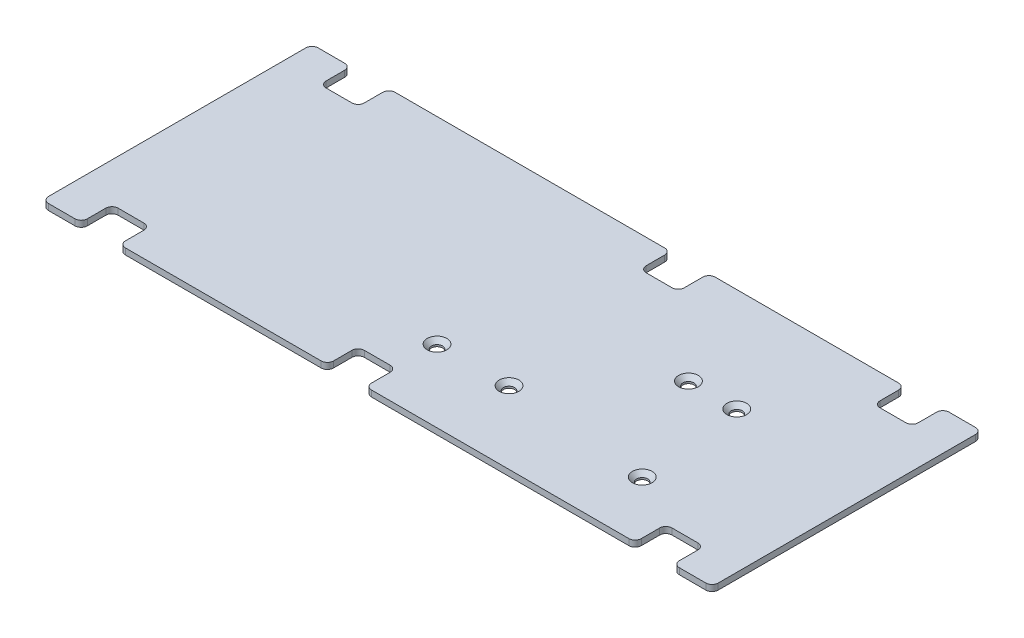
ISO-10303-21;
HEADER;
FILE_DESCRIPTION(('STEP AP214'),'2;1');
FILE_NAME('part.step','',(''),(''),'','','');
FILE_SCHEMA(('AUTOMOTIVE_DESIGN { 1 0 10303 214 1 1 1 1 }'));
ENDSEC;
DATA;
#1=APPLICATION_CONTEXT('core data for automotive mechanical design processes');
#2=APPLICATION_PROTOCOL_DEFINITION('international standard','automotive_design',2000,#1);
#3=PRODUCT_CONTEXT('',#1,'mechanical');
#4=PRODUCT('Part','Part','',(#3));
#5=PRODUCT_RELATED_PRODUCT_CATEGORY('part','',(#4));
#6=PRODUCT_DEFINITION_FORMATION('','',#4);
#7=PRODUCT_DEFINITION_CONTEXT('part definition',#1,'design');
#8=PRODUCT_DEFINITION('design','',#6,#7);
#9=PRODUCT_DEFINITION_SHAPE('','',#8);
#10=(LENGTH_UNIT() NAMED_UNIT(*) SI_UNIT(.MILLI.,.METRE.));
#11=(NAMED_UNIT(*) PLANE_ANGLE_UNIT() SI_UNIT($,.RADIAN.));
#12=(NAMED_UNIT(*) SI_UNIT($,.STERADIAN.) SOLID_ANGLE_UNIT());
#13=UNCERTAINTY_MEASURE_WITH_UNIT(LENGTH_MEASURE(1.E-05),#10,'distance_accuracy_value','');
#14=(GEOMETRIC_REPRESENTATION_CONTEXT(3) GLOBAL_UNCERTAINTY_ASSIGNED_CONTEXT((#13)) GLOBAL_UNIT_ASSIGNED_CONTEXT((#10,
#11,#12)) REPRESENTATION_CONTEXT('',''));
#15=CARTESIAN_POINT('',(0.,0.,0.));
#16=DIRECTION('',(0.,0.,1.));
#17=DIRECTION('',(1.,0.,0.));
#18=AXIS2_PLACEMENT_3D('',#15,#16,#17);
#19=CARTESIAN_POINT('',(252.806588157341,1.,-1.60000000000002));
#20=DIRECTION('',(0.,-1.,0.));
#21=DIRECTION('',(0.,0.,-1.));
#22=AXIS2_PLACEMENT_3D('',#19,#20,#21);
#23=CYLINDRICAL_SURFACE('',#22,1.);
#24=CARTESIAN_POINT('',(252.806588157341,0.,-1.60000000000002));
#25=DIRECTION('',(0.,1.,0.));
#26=DIRECTION('',(0.,0.,1.));
#27=AXIS2_PLACEMENT_3D('',#24,#25,#26);
#28=CIRCLE('',#27,1.);
#29=CARTESIAN_POINT('',(252.806588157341,0.,-0.600000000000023));
#30=VERTEX_POINT('',#29);
#31=CARTESIAN_POINT('',(253.806588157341,0.,-1.59999983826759));
#32=VERTEX_POINT('',#31);
#33=EDGE_CURVE('E437',#30,#32,#28,.T.);
#34=ORIENTED_EDGE('',*,*,#33,.T.);
#35=DIRECTION('',(0.,-1.,0.));
#36=VECTOR('',#35,1.);
#37=CARTESIAN_POINT('',(253.806588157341,1.,-1.59999983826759));
#38=LINE('',#37,#36);
#39=CARTESIAN_POINT('',(253.806588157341,1.,-1.59999983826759));
#40=VERTEX_POINT('',#39);
#41=EDGE_CURVE('E11',#40,#32,#38,.T.);
#42=ORIENTED_EDGE('',*,*,#41,.F.);
#43=CARTESIAN_POINT('',(252.806588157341,1.,-1.60000000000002));
#44=DIRECTION('',(0.,1.,0.));
#45=DIRECTION('',(0.,0.,1.));
#46=AXIS2_PLACEMENT_3D('',#43,#44,#45);
#47=CIRCLE('',#46,1.);
#48=CARTESIAN_POINT('',(252.806588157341,1.,-0.600000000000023));
#49=VERTEX_POINT('',#48);
#50=EDGE_CURVE('E604',#49,#40,#47,.T.);
#51=ORIENTED_EDGE('',*,*,#50,.F.);
#52=DIRECTION('',(0.,-1.,0.));
#53=VECTOR('',#52,1.);
#54=CARTESIAN_POINT('',(252.806588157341,1.,-0.600000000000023));
#55=LINE('',#54,#53);
#56=EDGE_CURVE('E433',#49,#30,#55,.T.);
#57=ORIENTED_EDGE('',*,*,#56,.T.);
#58=EDGE_LOOP('',(#34,#42,#51,#57));
#59=FACE_BOUND('',#58,.T.);
#60=ADVANCED_FACE('F44',(#59),#23,.T.);
#61=CARTESIAN_POINT('',(253.806588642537,1.,-4.59999415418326));
#62=DIRECTION('',(-0.999999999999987,0.,-1.61732415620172E-07));
#63=DIRECTION('',(-1.61732415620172E-07,0.,0.999999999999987));
#64=AXIS2_PLACEMENT_3D('',#61,#62,#63);
#65=PLANE('',#64);
#66=DIRECTION('',(1.61732415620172E-07,0.,-0.999999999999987));
#67=VECTOR('',#66,1.);
#68=CARTESIAN_POINT('',(253.806588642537,0.,-4.59999415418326));
#69=LINE('',#68,#67);
#70=CARTESIAN_POINT('',(253.806588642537,0.,-4.59999415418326));
#71=VERTEX_POINT('',#70);
#72=EDGE_CURVE('E441',#32,#71,#69,.T.);
#73=ORIENTED_EDGE('',*,*,#72,.T.);
#74=DIRECTION('',(0.,-1.,0.));
#75=VECTOR('',#74,1.);
#76=CARTESIAN_POINT('',(253.806588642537,1.,-4.59999415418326));
#77=LINE('',#76,#75);
#78=CARTESIAN_POINT('',(253.806588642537,1.,-4.59999415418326));
#79=VERTEX_POINT('',#78);
#80=EDGE_CURVE('E54',#79,#71,#77,.T.);
#81=ORIENTED_EDGE('',*,*,#80,.F.);
#82=DIRECTION('',(1.61732415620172E-07,0.,-0.999999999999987));
#83=VECTOR('',#82,1.);
#84=CARTESIAN_POINT('',(253.806588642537,1.,-4.59999415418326));
#85=LINE('',#84,#83);
#86=EDGE_CURVE('E250',#40,#79,#85,.T.);
#87=ORIENTED_EDGE('',*,*,#86,.F.);
#88=ORIENTED_EDGE('',*,*,#41,.T.);
#89=EDGE_LOOP('',(#73,#81,#87,#88));
#90=FACE_BOUND('',#89,.T.);
#91=ADVANCED_FACE('F1312',(#90),#65,.F.);
#92=CARTESIAN_POINT('',(254.806588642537,1.,-4.59999399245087));
#93=DIRECTION('',(0.,-1.,0.));
#94=DIRECTION('',(0.,0.,-1.));
#95=AXIS2_PLACEMENT_3D('',#92,#93,#94);
#96=CYLINDRICAL_SURFACE('',#95,1.00000000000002);
#97=CARTESIAN_POINT('',(254.806588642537,0.,-4.59999399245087));
#98=DIRECTION('',(0.,-1.,0.));
#99=DIRECTION('',(0.,0.,1.));
#100=AXIS2_PLACEMENT_3D('',#97,#98,#99);
#101=CIRCLE('',#100,1.00000000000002);
#102=CARTESIAN_POINT('',(254.806588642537,0.,-5.59999399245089));
#103=VERTEX_POINT('',#102);
#104=EDGE_CURVE('E445',#71,#103,#101,.T.);
#105=ORIENTED_EDGE('',*,*,#104,.T.);
#106=DIRECTION('',(0.,-1.,0.));
#107=VECTOR('',#106,1.);
#108=CARTESIAN_POINT('',(254.806588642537,1.,-5.59999399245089));
#109=LINE('',#108,#107);
#110=CARTESIAN_POINT('',(254.806588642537,1.,-5.59999399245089));
#111=VERTEX_POINT('',#110);
#112=EDGE_CURVE('E807',#111,#103,#109,.T.);
#113=ORIENTED_EDGE('',*,*,#112,.F.);
#114=CARTESIAN_POINT('',(254.806588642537,1.,-4.59999399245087));
#115=DIRECTION('',(0.,-1.,0.));
#116=DIRECTION('',(0.,0.,1.));
#117=AXIS2_PLACEMENT_3D('',#114,#115,#116);
#118=CIRCLE('',#117,1.00000000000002);
#119=EDGE_CURVE('E873',#79,#111,#118,.T.);
#120=ORIENTED_EDGE('',*,*,#119,.F.);
#121=ORIENTED_EDGE('',*,*,#80,.T.);
#122=EDGE_LOOP('',(#105,#113,#120,#121));
#123=FACE_BOUND('',#122,.T.);
#124=ADVANCED_FACE('F1317',(#123),#96,.F.);
#125=CARTESIAN_POINT('',(259.006587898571,1.,-5.59999399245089));
#126=DIRECTION('',(0.,0.,-1.));
#127=DIRECTION('',(-1.,0.,0.));
#128=AXIS2_PLACEMENT_3D('',#125,#126,#127);
#129=PLANE('',#128);
#130=DIRECTION('',(1.,0.,0.));
#131=VECTOR('',#130,1.);
#132=CARTESIAN_POINT('',(259.006587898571,0.,-5.59999399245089));
#133=LINE('',#132,#131);
#134=CARTESIAN_POINT('',(259.006587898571,0.,-5.59999399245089));
#135=VERTEX_POINT('',#134);
#136=EDGE_CURVE('E448',#103,#135,#133,.T.);
#137=ORIENTED_EDGE('',*,*,#136,.T.);
#138=DIRECTION('',(0.,-1.,0.));
#139=VECTOR('',#138,1.);
#140=CARTESIAN_POINT('',(259.006587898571,1.,-5.59999399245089));
#141=LINE('',#140,#139);
#142=CARTESIAN_POINT('',(259.006587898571,1.,-5.59999399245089));
#143=VERTEX_POINT('',#142);
#144=EDGE_CURVE('E803',#143,#135,#141,.T.);
#145=ORIENTED_EDGE('',*,*,#144,.F.);
#146=DIRECTION('',(1.,0.,0.));
#147=VECTOR('',#146,1.);
#148=CARTESIAN_POINT('',(259.006587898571,1.,-5.59999399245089));
#149=LINE('',#148,#147);
#150=EDGE_CURVE('E876',#111,#143,#149,.T.);
#151=ORIENTED_EDGE('',*,*,#150,.F.);
#152=ORIENTED_EDGE('',*,*,#112,.T.);
#153=EDGE_LOOP('',(#137,#145,#151,#152));
#154=FACE_BOUND('',#153,.T.);
#155=ADVANCED_FACE('F1332',(#154),#129,.F.);
#156=CARTESIAN_POINT('',(259.006587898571,1.,-4.59999399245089));
#157=DIRECTION('',(0.,-1.,0.));
#158=DIRECTION('',(0.,0.,-1.));
#159=AXIS2_PLACEMENT_3D('',#156,#157,#158);
#160=CYLINDRICAL_SURFACE('',#159,1.);
#161=CARTESIAN_POINT('',(259.006587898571,0.,-4.59999399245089));
#162=DIRECTION('',(0.,-1.,0.));
#163=DIRECTION('',(0.,0.,1.));
#164=AXIS2_PLACEMENT_3D('',#161,#162,#163);
#165=CIRCLE('',#164,1.);
#166=CARTESIAN_POINT('',(260.006587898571,0.,-4.59999399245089));
#167=VERTEX_POINT('',#166);
#168=EDGE_CURVE('E451',#135,#167,#165,.T.);
#169=ORIENTED_EDGE('',*,*,#168,.T.);
#170=DIRECTION('',(0.,-1.,0.));
#171=VECTOR('',#170,1.);
#172=CARTESIAN_POINT('',(260.006587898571,1.,-4.59999399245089));
#173=LINE('',#172,#171);
#174=CARTESIAN_POINT('',(260.006587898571,1.,-4.59999399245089));
#175=VERTEX_POINT('',#174);
#176=EDGE_CURVE('E799',#175,#167,#173,.T.);
#177=ORIENTED_EDGE('',*,*,#176,.F.);
#178=CARTESIAN_POINT('',(259.006587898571,1.,-4.59999399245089));
#179=DIRECTION('',(0.,-1.,0.));
#180=DIRECTION('',(0.,0.,1.));
#181=AXIS2_PLACEMENT_3D('',#178,#179,#180);
#182=CIRCLE('',#181,1.);
#183=EDGE_CURVE('E879',#143,#175,#182,.T.);
#184=ORIENTED_EDGE('',*,*,#183,.F.);
#185=ORIENTED_EDGE('',*,*,#144,.T.);
#186=EDGE_LOOP('',(#169,#177,#184,#185));
#187=FACE_BOUND('',#186,.T.);
#188=ADVANCED_FACE('F1335',(#187),#160,.F.);
#189=CARTESIAN_POINT('',(260.006587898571,1.,-1.60000000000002));
#190=DIRECTION('',(1.,0.,0.));
#191=DIRECTION('',(0.,0.,-1.));
#192=AXIS2_PLACEMENT_3D('',#189,#190,#191);
#193=PLANE('',#192);
#194=DIRECTION('',(0.,0.,1.));
#195=VECTOR('',#194,1.);
#196=CARTESIAN_POINT('',(260.006587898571,0.,-1.60000000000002));
#197=LINE('',#196,#195);
#198=CARTESIAN_POINT('',(260.006587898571,0.,-1.60000000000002));
#199=VERTEX_POINT('',#198);
#200=EDGE_CURVE('E454',#167,#199,#197,.T.);
#201=ORIENTED_EDGE('',*,*,#200,.T.);
#202=DIRECTION('',(0.,-1.,0.));
#203=VECTOR('',#202,1.);
#204=CARTESIAN_POINT('',(260.006587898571,1.,-1.60000000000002));
#205=LINE('',#204,#203);
#206=CARTESIAN_POINT('',(260.006587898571,1.,-1.60000000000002));
#207=VERTEX_POINT('',#206);
#208=EDGE_CURVE('E795',#207,#199,#205,.T.);
#209=ORIENTED_EDGE('',*,*,#208,.F.);
#210=DIRECTION('',(0.,0.,1.));
#211=VECTOR('',#210,1.);
#212=CARTESIAN_POINT('',(260.006587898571,1.,-1.60000000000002));
#213=LINE('',#212,#211);
#214=EDGE_CURVE('E882',#175,#207,#213,.T.);
#215=ORIENTED_EDGE('',*,*,#214,.F.);
#216=ORIENTED_EDGE('',*,*,#176,.T.);
#217=EDGE_LOOP('',(#201,#209,#215,#216));
#218=FACE_BOUND('',#217,.T.);
#219=ADVANCED_FACE('F1340',(#218),#193,.F.);
#220=CARTESIAN_POINT('',(261.006587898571,1.,-1.60000000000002));
#221=DIRECTION('',(0.,-1.,0.));
#222=DIRECTION('',(0.,0.,-1.));
#223=AXIS2_PLACEMENT_3D('',#220,#221,#222);
#224=CYLINDRICAL_SURFACE('',#223,1.);
#225=CARTESIAN_POINT('',(261.006587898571,0.,-1.60000000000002));
#226=DIRECTION('',(0.,1.,0.));
#227=DIRECTION('',(0.,0.,1.));
#228=AXIS2_PLACEMENT_3D('',#225,#226,#227);
#229=CIRCLE('',#228,1.);
#230=CARTESIAN_POINT('',(261.006587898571,0.,-0.600000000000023));
#231=VERTEX_POINT('',#230);
#232=EDGE_CURVE('E457',#199,#231,#229,.T.);
#233=ORIENTED_EDGE('',*,*,#232,.T.);
#234=DIRECTION('',(0.,-1.,0.));
#235=VECTOR('',#234,1.);
#236=CARTESIAN_POINT('',(261.006587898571,1.,-0.600000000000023));
#237=LINE('',#236,#235);
#238=CARTESIAN_POINT('',(261.006587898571,1.,-0.600000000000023));
#239=VERTEX_POINT('',#238);
#240=EDGE_CURVE('E791',#239,#231,#237,.T.);
#241=ORIENTED_EDGE('',*,*,#240,.F.);
#242=CARTESIAN_POINT('',(261.006587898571,1.,-1.60000000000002));
#243=DIRECTION('',(0.,1.,0.));
#244=DIRECTION('',(0.,0.,1.));
#245=AXIS2_PLACEMENT_3D('',#242,#243,#244);
#246=CIRCLE('',#245,1.);
#247=EDGE_CURVE('E885',#207,#239,#246,.T.);
#248=ORIENTED_EDGE('',*,*,#247,.F.);
#249=ORIENTED_EDGE('',*,*,#208,.T.);
#250=EDGE_LOOP('',(#233,#241,#248,#249));
#251=FACE_BOUND('',#250,.T.);
#252=ADVANCED_FACE('F1346',(#251),#224,.T.);
#253=CARTESIAN_POINT('',(265.306587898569,1.,-0.600000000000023));
#254=DIRECTION('',(0.,0.,-1.));
#255=DIRECTION('',(-1.,0.,0.));
#256=AXIS2_PLACEMENT_3D('',#253,#254,#255);
#257=PLANE('',#256);
#258=DIRECTION('',(1.,0.,0.));
#259=VECTOR('',#258,1.);
#260=CARTESIAN_POINT('',(265.306587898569,0.,-0.600000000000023));
#261=LINE('',#260,#259);
#262=CARTESIAN_POINT('',(265.306587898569,0.,-0.600000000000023));
#263=VERTEX_POINT('',#262);
#264=EDGE_CURVE('E460',#231,#263,#261,.T.);
#265=ORIENTED_EDGE('',*,*,#264,.T.);
#266=DIRECTION('',(0.,-1.,0.));
#267=VECTOR('',#266,1.);
#268=CARTESIAN_POINT('',(265.306587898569,1.,-0.600000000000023));
#269=LINE('',#268,#267);
#270=CARTESIAN_POINT('',(265.306587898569,1.,-0.600000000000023));
#271=VERTEX_POINT('',#270);
#272=EDGE_CURVE('E787',#271,#263,#269,.T.);
#273=ORIENTED_EDGE('',*,*,#272,.F.);
#274=DIRECTION('',(1.,0.,0.));
#275=VECTOR('',#274,1.);
#276=CARTESIAN_POINT('',(265.306587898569,1.,-0.600000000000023));
#277=LINE('',#276,#275);
#278=EDGE_CURVE('E888',#239,#271,#277,.T.);
#279=ORIENTED_EDGE('',*,*,#278,.F.);
#280=ORIENTED_EDGE('',*,*,#240,.T.);
#281=EDGE_LOOP('',(#265,#273,#279,#280));
#282=FACE_BOUND('',#281,.T.);
#283=ADVANCED_FACE('F1350',(#282),#257,.F.);
#284=CARTESIAN_POINT('',(265.306587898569,1.,-1.60000000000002));
#285=DIRECTION('',(0.,-1.,0.));
#286=DIRECTION('',(0.,0.,-1.));
#287=AXIS2_PLACEMENT_3D('',#284,#285,#286);
#288=CYLINDRICAL_SURFACE('',#287,1.);
#289=CARTESIAN_POINT('',(265.306587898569,0.,-1.60000000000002));
#290=DIRECTION('',(0.,1.,0.));
#291=DIRECTION('',(0.,0.,1.));
#292=AXIS2_PLACEMENT_3D('',#289,#290,#291);
#293=CIRCLE('',#292,1.);
#294=CARTESIAN_POINT('',(266.306587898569,0.,-1.60000000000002));
#295=VERTEX_POINT('',#294);
#296=EDGE_CURVE('E463',#263,#295,#293,.T.);
#297=ORIENTED_EDGE('',*,*,#296,.T.);
#298=DIRECTION('',(0.,-1.,0.));
#299=VECTOR('',#298,1.);
#300=CARTESIAN_POINT('',(266.306587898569,1.,-1.60000000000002));
#301=LINE('',#300,#299);
#302=CARTESIAN_POINT('',(266.306587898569,1.,-1.60000000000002));
#303=VERTEX_POINT('',#302);
#304=EDGE_CURVE('E783',#303,#295,#301,.T.);
#305=ORIENTED_EDGE('',*,*,#304,.F.);
#306=CARTESIAN_POINT('',(265.306587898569,1.,-1.60000000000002));
#307=DIRECTION('',(0.,1.,0.));
#308=DIRECTION('',(0.,0.,1.));
#309=AXIS2_PLACEMENT_3D('',#306,#307,#308);
#310=CIRCLE('',#309,1.);
#311=EDGE_CURVE('E891',#271,#303,#310,.T.);
#312=ORIENTED_EDGE('',*,*,#311,.F.);
#313=ORIENTED_EDGE('',*,*,#272,.T.);
#314=EDGE_LOOP('',(#297,#305,#312,#313));
#315=FACE_BOUND('',#314,.T.);
#316=ADVANCED_FACE('F1355',(#315),#288,.T.);
#317=CARTESIAN_POINT('',(266.306587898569,1.,-43.4));
#318=DIRECTION('',(-1.,0.,0.));
#319=DIRECTION('',(0.,0.,1.));
#320=AXIS2_PLACEMENT_3D('',#317,#318,#319);
#321=PLANE('',#320);
#322=DIRECTION('',(0.,0.,-1.));
#323=VECTOR('',#322,1.);
#324=CARTESIAN_POINT('',(266.306587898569,0.,-43.4));
#325=LINE('',#324,#323);
#326=CARTESIAN_POINT('',(266.306587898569,0.,-43.4));
#327=VERTEX_POINT('',#326);
#328=EDGE_CURVE('E466',#295,#327,#325,.T.);
#329=ORIENTED_EDGE('',*,*,#328,.T.);
#330=DIRECTION('',(0.,-1.,0.));
#331=VECTOR('',#330,1.);
#332=CARTESIAN_POINT('',(266.306587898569,1.,-43.4));
#333=LINE('',#332,#331);
#334=CARTESIAN_POINT('',(266.306587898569,1.,-43.4));
#335=VERTEX_POINT('',#334);
#336=EDGE_CURVE('E779',#335,#327,#333,.T.);
#337=ORIENTED_EDGE('',*,*,#336,.F.);
#338=DIRECTION('',(0.,0.,-1.));
#339=VECTOR('',#338,1.);
#340=CARTESIAN_POINT('',(266.306587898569,1.,-43.4));
#341=LINE('',#340,#339);
#342=EDGE_CURVE('E894',#303,#335,#341,.T.);
#343=ORIENTED_EDGE('',*,*,#342,.F.);
#344=ORIENTED_EDGE('',*,*,#304,.T.);
#345=EDGE_LOOP('',(#329,#337,#343,#344));
#346=FACE_BOUND('',#345,.T.);
#347=ADVANCED_FACE('F1361',(#346),#321,.F.);
#348=CARTESIAN_POINT('',(265.306587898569,1.,-43.4));
#349=DIRECTION('',(0.,-1.,0.));
#350=DIRECTION('',(0.,0.,-1.));
#351=AXIS2_PLACEMENT_3D('',#348,#349,#350);
#352=CYLINDRICAL_SURFACE('',#351,1.);
#353=CARTESIAN_POINT('',(265.306587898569,0.,-43.4));
#354=DIRECTION('',(0.,1.,0.));
#355=DIRECTION('',(0.,0.,1.));
#356=AXIS2_PLACEMENT_3D('',#353,#354,#355);
#357=CIRCLE('',#356,1.);
#358=CARTESIAN_POINT('',(265.306587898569,0.,-44.4));
#359=VERTEX_POINT('',#358);
#360=EDGE_CURVE('E469',#327,#359,#357,.T.);
#361=ORIENTED_EDGE('',*,*,#360,.T.);
#362=DIRECTION('',(0.,-1.,0.));
#363=VECTOR('',#362,1.);
#364=CARTESIAN_POINT('',(265.306587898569,1.,-44.4));
#365=LINE('',#364,#363);
#366=CARTESIAN_POINT('',(265.306587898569,1.,-44.4));
#367=VERTEX_POINT('',#366);
#368=EDGE_CURVE('E775',#367,#359,#365,.T.);
#369=ORIENTED_EDGE('',*,*,#368,.F.);
#370=CARTESIAN_POINT('',(265.306587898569,1.,-43.4));
#371=DIRECTION('',(0.,1.,0.));
#372=DIRECTION('',(0.,0.,1.));
#373=AXIS2_PLACEMENT_3D('',#370,#371,#372);
#374=CIRCLE('',#373,1.);
#375=EDGE_CURVE('E897',#335,#367,#374,.T.);
#376=ORIENTED_EDGE('',*,*,#375,.F.);
#377=ORIENTED_EDGE('',*,*,#336,.T.);
#378=EDGE_LOOP('',(#361,#369,#376,#377));
#379=FACE_BOUND('',#378,.T.);
#380=ADVANCED_FACE('F1365',(#379),#352,.T.);
#381=CARTESIAN_POINT('',(261.006587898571,1.,-44.4));
#382=DIRECTION('',(0.,0.,1.));
#383=DIRECTION('',(1.,0.,0.));
#384=AXIS2_PLACEMENT_3D('',#381,#382,#383);
#385=PLANE('',#384);
#386=DIRECTION('',(-1.,0.,0.));
#387=VECTOR('',#386,1.);
#388=CARTESIAN_POINT('',(261.006587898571,0.,-44.4));
#389=LINE('',#388,#387);
#390=CARTESIAN_POINT('',(261.006587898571,0.,-44.4));
#391=VERTEX_POINT('',#390);
#392=EDGE_CURVE('E472',#359,#391,#389,.T.);
#393=ORIENTED_EDGE('',*,*,#392,.T.);
#394=DIRECTION('',(0.,-1.,0.));
#395=VECTOR('',#394,1.);
#396=CARTESIAN_POINT('',(261.006587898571,1.,-44.4));
#397=LINE('',#396,#395);
#398=CARTESIAN_POINT('',(261.006587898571,1.,-44.4));
#399=VERTEX_POINT('',#398);
#400=EDGE_CURVE('E771',#399,#391,#397,.T.);
#401=ORIENTED_EDGE('',*,*,#400,.F.);
#402=DIRECTION('',(-1.,0.,0.));
#403=VECTOR('',#402,1.);
#404=CARTESIAN_POINT('',(261.006587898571,1.,-44.4));
#405=LINE('',#404,#403);
#406=EDGE_CURVE('E900',#367,#399,#405,.T.);
#407=ORIENTED_EDGE('',*,*,#406,.F.);
#408=ORIENTED_EDGE('',*,*,#368,.T.);
#409=EDGE_LOOP('',(#393,#401,#407,#408));
#410=FACE_BOUND('',#409,.T.);
#411=ADVANCED_FACE('F1370',(#410),#385,.F.);
#412=CARTESIAN_POINT('',(261.006587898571,1.,-43.4));
#413=DIRECTION('',(0.,-1.,0.));
#414=DIRECTION('',(0.,0.,-1.));
#415=AXIS2_PLACEMENT_3D('',#412,#413,#414);
#416=CYLINDRICAL_SURFACE('',#415,1.);
#417=CARTESIAN_POINT('',(261.006587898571,0.,-43.4));
#418=DIRECTION('',(0.,1.,0.));
#419=DIRECTION('',(0.,0.,1.));
#420=AXIS2_PLACEMENT_3D('',#417,#418,#419);
#421=CIRCLE('',#420,1.);
#422=CARTESIAN_POINT('',(260.006587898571,0.,-43.4));
#423=VERTEX_POINT('',#422);
#424=EDGE_CURVE('E475',#391,#423,#421,.T.);
#425=ORIENTED_EDGE('',*,*,#424,.T.);
#426=DIRECTION('',(0.,-1.,0.));
#427=VECTOR('',#426,1.);
#428=CARTESIAN_POINT('',(260.006587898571,1.,-43.4));
#429=LINE('',#428,#427);
#430=CARTESIAN_POINT('',(260.006587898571,1.,-43.4));
#431=VERTEX_POINT('',#430);
#432=EDGE_CURVE('E767',#431,#423,#429,.T.);
#433=ORIENTED_EDGE('',*,*,#432,.F.);
#434=CARTESIAN_POINT('',(261.006587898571,1.,-43.4));
#435=DIRECTION('',(0.,1.,0.));
#436=DIRECTION('',(0.,0.,1.));
#437=AXIS2_PLACEMENT_3D('',#434,#435,#436);
#438=CIRCLE('',#437,1.);
#439=EDGE_CURVE('E903',#399,#431,#438,.T.);
#440=ORIENTED_EDGE('',*,*,#439,.F.);
#441=ORIENTED_EDGE('',*,*,#400,.T.);
#442=EDGE_LOOP('',(#425,#433,#440,#441));
#443=FACE_BOUND('',#442,.T.);
#444=ADVANCED_FACE('F1376',(#443),#416,.T.);
#445=CARTESIAN_POINT('',(260.006587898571,1.,-40.4000060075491));
#446=DIRECTION('',(1.,0.,0.));
#447=DIRECTION('',(0.,0.,-1.));
#448=AXIS2_PLACEMENT_3D('',#445,#446,#447);
#449=PLANE('',#448);
#450=DIRECTION('',(0.,0.,1.));
#451=VECTOR('',#450,1.);
#452=CARTESIAN_POINT('',(260.006587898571,0.,-40.4000060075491));
#453=LINE('',#452,#451);
#454=CARTESIAN_POINT('',(260.006587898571,0.,-40.4000060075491));
#455=VERTEX_POINT('',#454);
#456=EDGE_CURVE('E478',#423,#455,#453,.T.);
#457=ORIENTED_EDGE('',*,*,#456,.T.);
#458=DIRECTION('',(0.,-1.,0.));
#459=VECTOR('',#458,1.);
#460=CARTESIAN_POINT('',(260.006587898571,1.,-40.4000060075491));
#461=LINE('',#460,#459);
#462=CARTESIAN_POINT('',(260.006587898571,1.,-40.4000060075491));
#463=VERTEX_POINT('',#462);
#464=EDGE_CURVE('E763',#463,#455,#461,.T.);
#465=ORIENTED_EDGE('',*,*,#464,.F.);
#466=DIRECTION('',(0.,0.,1.));
#467=VECTOR('',#466,1.);
#468=CARTESIAN_POINT('',(260.006587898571,1.,-40.4000060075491));
#469=LINE('',#468,#467);
#470=EDGE_CURVE('E906',#431,#463,#469,.T.);
#471=ORIENTED_EDGE('',*,*,#470,.F.);
#472=ORIENTED_EDGE('',*,*,#432,.T.);
#473=EDGE_LOOP('',(#457,#465,#471,#472));
#474=FACE_BOUND('',#473,.T.);
#475=ADVANCED_FACE('F1380',(#474),#449,.F.);
#476=CARTESIAN_POINT('',(259.006587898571,1.,-40.4000060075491));
#477=DIRECTION('',(0.,-1.,0.));
#478=DIRECTION('',(0.,0.,-1.));
#479=AXIS2_PLACEMENT_3D('',#476,#477,#478);
#480=CYLINDRICAL_SURFACE('',#479,1.);
#481=CARTESIAN_POINT('',(259.006587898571,0.,-40.4000060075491));
#482=DIRECTION('',(0.,-1.,0.));
#483=DIRECTION('',(0.,0.,1.));
#484=AXIS2_PLACEMENT_3D('',#481,#482,#483);
#485=CIRCLE('',#484,1.);
#486=CARTESIAN_POINT('',(259.006587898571,0.,-39.4000060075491));
#487=VERTEX_POINT('',#486);
#488=EDGE_CURVE('E481',#455,#487,#485,.T.);
#489=ORIENTED_EDGE('',*,*,#488,.T.);
#490=DIRECTION('',(0.,-1.,0.));
#491=VECTOR('',#490,1.);
#492=CARTESIAN_POINT('',(259.006587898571,1.,-39.4000060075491));
#493=LINE('',#492,#491);
#494=CARTESIAN_POINT('',(259.006587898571,1.,-39.4000060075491));
#495=VERTEX_POINT('',#494);
#496=EDGE_CURVE('E759',#495,#487,#493,.T.);
#497=ORIENTED_EDGE('',*,*,#496,.F.);
#498=CARTESIAN_POINT('',(259.006587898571,1.,-40.4000060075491));
#499=DIRECTION('',(0.,-1.,0.));
#500=DIRECTION('',(0.,0.,1.));
#501=AXIS2_PLACEMENT_3D('',#498,#499,#500);
#502=CIRCLE('',#501,1.);
#503=EDGE_CURVE('E909',#463,#495,#502,.T.);
#504=ORIENTED_EDGE('',*,*,#503,.F.);
#505=ORIENTED_EDGE('',*,*,#464,.T.);
#506=EDGE_LOOP('',(#489,#497,#504,#505));
#507=FACE_BOUND('',#506,.T.);
#508=ADVANCED_FACE('F1385',(#507),#480,.F.);
#509=CARTESIAN_POINT('',(254.806588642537,1.,-39.4000060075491));
#510=DIRECTION('',(0.,0.,1.));
#511=DIRECTION('',(1.,0.,0.));
#512=AXIS2_PLACEMENT_3D('',#509,#510,#511);
#513=PLANE('',#512);
#514=DIRECTION('',(-1.,0.,0.));
#515=VECTOR('',#514,1.);
#516=CARTESIAN_POINT('',(254.806588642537,0.,-39.4000060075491));
#517=LINE('',#516,#515);
#518=CARTESIAN_POINT('',(254.806588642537,0.,-39.4000060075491));
#519=VERTEX_POINT('',#518);
#520=EDGE_CURVE('E484',#487,#519,#517,.T.);
#521=ORIENTED_EDGE('',*,*,#520,.T.);
#522=DIRECTION('',(0.,-1.,0.));
#523=VECTOR('',#522,1.);
#524=CARTESIAN_POINT('',(254.806588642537,1.,-39.4000060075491));
#525=LINE('',#524,#523);
#526=CARTESIAN_POINT('',(254.806588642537,1.,-39.4000060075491));
#527=VERTEX_POINT('',#526);
#528=EDGE_CURVE('E755',#527,#519,#525,.T.);
#529=ORIENTED_EDGE('',*,*,#528,.F.);
#530=DIRECTION('',(-1.,0.,0.));
#531=VECTOR('',#530,1.);
#532=CARTESIAN_POINT('',(254.806588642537,1.,-39.4000060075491));
#533=LINE('',#532,#531);
#534=EDGE_CURVE('E912',#495,#527,#533,.T.);
#535=ORIENTED_EDGE('',*,*,#534,.F.);
#536=ORIENTED_EDGE('',*,*,#496,.T.);
#537=EDGE_LOOP('',(#521,#529,#535,#536));
#538=FACE_BOUND('',#537,.T.);
#539=ADVANCED_FACE('F1391',(#538),#513,.F.);
#540=CARTESIAN_POINT('',(254.806588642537,1.,-40.4000060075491));
#541=DIRECTION('',(0.,-1.,0.));
#542=DIRECTION('',(0.,0.,-1.));
#543=AXIS2_PLACEMENT_3D('',#540,#541,#542);
#544=CYLINDRICAL_SURFACE('',#543,1.00000000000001);
#545=CARTESIAN_POINT('',(254.806588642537,0.,-40.4000060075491));
#546=DIRECTION('',(0.,-1.,0.));
#547=DIRECTION('',(0.,0.,1.));
#548=AXIS2_PLACEMENT_3D('',#545,#546,#547);
#549=CIRCLE('',#548,1.00000000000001);
#550=CARTESIAN_POINT('',(253.806588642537,0.,-40.4000058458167));
#551=VERTEX_POINT('',#550);
#552=EDGE_CURVE('E487',#519,#551,#549,.T.);
#553=ORIENTED_EDGE('',*,*,#552,.T.);
#554=DIRECTION('',(0.,-1.,0.));
#555=VECTOR('',#554,1.);
#556=CARTESIAN_POINT('',(253.806588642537,1.,-40.4000058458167));
#557=LINE('',#556,#555);
#558=CARTESIAN_POINT('',(253.806588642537,1.,-40.4000058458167));
#559=VERTEX_POINT('',#558);
#560=EDGE_CURVE('E751',#559,#551,#557,.T.);
#561=ORIENTED_EDGE('',*,*,#560,.F.);
#562=CARTESIAN_POINT('',(254.806588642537,1.,-40.4000060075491));
#563=DIRECTION('',(0.,-1.,0.));
#564=DIRECTION('',(0.,0.,1.));
#565=AXIS2_PLACEMENT_3D('',#562,#563,#564);
#566=CIRCLE('',#565,1.00000000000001);
#567=EDGE_CURVE('E915',#527,#559,#566,.T.);
#568=ORIENTED_EDGE('',*,*,#567,.F.);
#569=ORIENTED_EDGE('',*,*,#528,.T.);
#570=EDGE_LOOP('',(#553,#561,#568,#569));
#571=FACE_BOUND('',#570,.T.);
#572=ADVANCED_FACE('F1395',(#571),#544,.F.);
#573=CARTESIAN_POINT('',(253.806588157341,1.,-43.4000001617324));
#574=DIRECTION('',(-0.999999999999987,0.,1.61732415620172E-07));
#575=DIRECTION('',(1.61732415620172E-07,0.,0.999999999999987));
#576=AXIS2_PLACEMENT_3D('',#573,#574,#575);
#577=PLANE('',#576);
#578=DIRECTION('',(-1.61732415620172E-07,0.,-0.999999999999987));
#579=VECTOR('',#578,1.);
#580=CARTESIAN_POINT('',(253.806588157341,0.,-43.4000001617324));
#581=LINE('',#580,#579);
#582=CARTESIAN_POINT('',(253.806588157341,0.,-43.4000001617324));
#583=VERTEX_POINT('',#582);
#584=EDGE_CURVE('E490',#551,#583,#581,.T.);
#585=ORIENTED_EDGE('',*,*,#584,.T.);
#586=DIRECTION('',(0.,-1.,0.));
#587=VECTOR('',#586,1.);
#588=CARTESIAN_POINT('',(253.806588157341,1.,-43.4000001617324));
#589=LINE('',#588,#587);
#590=CARTESIAN_POINT('',(253.806588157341,1.,-43.4000001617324));
#591=VERTEX_POINT('',#590);
#592=EDGE_CURVE('E747',#591,#583,#589,.T.);
#593=ORIENTED_EDGE('',*,*,#592,.F.);
#594=DIRECTION('',(-1.61732415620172E-07,0.,-0.999999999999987));
#595=VECTOR('',#594,1.);
#596=CARTESIAN_POINT('',(253.806588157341,1.,-43.4000001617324));
#597=LINE('',#596,#595);
#598=EDGE_CURVE('E918',#559,#591,#597,.T.);
#599=ORIENTED_EDGE('',*,*,#598,.F.);
#600=ORIENTED_EDGE('',*,*,#560,.T.);
#601=EDGE_LOOP('',(#585,#593,#599,#600));
#602=FACE_BOUND('',#601,.T.);
#603=ADVANCED_FACE('F1400',(#602),#577,.F.);
#604=CARTESIAN_POINT('',(252.806588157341,1.,-43.4));
#605=DIRECTION('',(0.,-1.,0.));
#606=DIRECTION('',(0.,0.,-1.));
#607=AXIS2_PLACEMENT_3D('',#604,#605,#606);
#608=CYLINDRICAL_SURFACE('',#607,1.00000000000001);
#609=CARTESIAN_POINT('',(252.806588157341,0.,-43.4));
#610=DIRECTION('',(0.,1.,0.));
#611=DIRECTION('',(0.,0.,1.));
#612=AXIS2_PLACEMENT_3D('',#609,#610,#611);
#613=CIRCLE('',#612,1.00000000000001);
#614=CARTESIAN_POINT('',(252.806588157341,0.,-44.4));
#615=VERTEX_POINT('',#614);
#616=EDGE_CURVE('E493',#583,#615,#613,.T.);
#617=ORIENTED_EDGE('',*,*,#616,.T.);
#618=DIRECTION('',(0.,-1.,0.));
#619=VECTOR('',#618,1.);
#620=CARTESIAN_POINT('',(252.806588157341,1.,-44.4));
#621=LINE('',#620,#619);
#622=CARTESIAN_POINT('',(252.806588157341,1.,-44.4));
#623=VERTEX_POINT('',#622);
#624=EDGE_CURVE('E743',#623,#615,#621,.T.);
#625=ORIENTED_EDGE('',*,*,#624,.F.);
#626=CARTESIAN_POINT('',(252.806588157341,1.,-43.4));
#627=DIRECTION('',(0.,1.,0.));
#628=DIRECTION('',(0.,0.,1.));
#629=AXIS2_PLACEMENT_3D('',#626,#627,#628);
#630=CIRCLE('',#629,1.00000000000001);
#631=EDGE_CURVE('E921',#591,#623,#630,.T.);
#632=ORIENTED_EDGE('',*,*,#631,.F.);
#633=ORIENTED_EDGE('',*,*,#592,.T.);
#634=EDGE_LOOP('',(#617,#625,#632,#633));
#635=FACE_BOUND('',#634,.T.);
#636=ADVANCED_FACE('F1406',(#635),#608,.T.);
#637=CARTESIAN_POINT('',(223.006587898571,1.,-44.4));
#638=DIRECTION('',(0.,0.,1.));
#639=DIRECTION('',(1.,0.,0.));
#640=AXIS2_PLACEMENT_3D('',#637,#638,#639);
#641=PLANE('',#640);
#642=DIRECTION('',(-1.,0.,0.));
#643=VECTOR('',#642,1.);
#644=CARTESIAN_POINT('',(223.006587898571,0.,-44.4));
#645=LINE('',#644,#643);
#646=CARTESIAN_POINT('',(223.006587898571,0.,-44.4));
#647=VERTEX_POINT('',#646);
#648=EDGE_CURVE('E496',#615,#647,#645,.T.);
#649=ORIENTED_EDGE('',*,*,#648,.T.);
#650=DIRECTION('',(0.,-1.,0.));
#651=VECTOR('',#650,1.);
#652=CARTESIAN_POINT('',(223.006587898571,1.,-44.4));
#653=LINE('',#652,#651);
#654=CARTESIAN_POINT('',(223.006587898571,1.,-44.4));
#655=VERTEX_POINT('',#654);
#656=EDGE_CURVE('E739',#655,#647,#653,.T.);
#657=ORIENTED_EDGE('',*,*,#656,.F.);
#658=DIRECTION('',(-1.,0.,0.));
#659=VECTOR('',#658,1.);
#660=CARTESIAN_POINT('',(223.006587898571,1.,-44.4));
#661=LINE('',#660,#659);
#662=EDGE_CURVE('E924',#623,#655,#661,.T.);
#663=ORIENTED_EDGE('',*,*,#662,.F.);
#664=ORIENTED_EDGE('',*,*,#624,.T.);
#665=EDGE_LOOP('',(#649,#657,#663,#664));
#666=FACE_BOUND('',#665,.T.);
#667=ADVANCED_FACE('F1410',(#666),#641,.F.);
#668=CARTESIAN_POINT('',(223.006587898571,1.,-43.4));
#669=DIRECTION('',(0.,-1.,0.));
#670=DIRECTION('',(0.,0.,-1.));
#671=AXIS2_PLACEMENT_3D('',#668,#669,#670);
#672=CYLINDRICAL_SURFACE('',#671,1.);
#673=CARTESIAN_POINT('',(223.006587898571,0.,-43.4));
#674=DIRECTION('',(0.,1.,0.));
#675=DIRECTION('',(0.,0.,1.));
#676=AXIS2_PLACEMENT_3D('',#673,#674,#675);
#677=CIRCLE('',#676,1.);
#678=CARTESIAN_POINT('',(222.006587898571,0.,-43.4));
#679=VERTEX_POINT('',#678);
#680=EDGE_CURVE('E499',#647,#679,#677,.T.);
#681=ORIENTED_EDGE('',*,*,#680,.T.);
#682=DIRECTION('',(0.,-1.,0.));
#683=VECTOR('',#682,1.);
#684=CARTESIAN_POINT('',(222.006587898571,1.,-43.4));
#685=LINE('',#684,#683);
#686=CARTESIAN_POINT('',(222.006587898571,1.,-43.4));
#687=VERTEX_POINT('',#686);
#688=EDGE_CURVE('E735',#687,#679,#685,.T.);
#689=ORIENTED_EDGE('',*,*,#688,.F.);
#690=CARTESIAN_POINT('',(223.006587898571,1.,-43.4));
#691=DIRECTION('',(0.,1.,0.));
#692=DIRECTION('',(0.,0.,1.));
#693=AXIS2_PLACEMENT_3D('',#690,#691,#692);
#694=CIRCLE('',#693,1.);
#695=EDGE_CURVE('E927',#655,#687,#694,.T.);
#696=ORIENTED_EDGE('',*,*,#695,.F.);
#697=ORIENTED_EDGE('',*,*,#656,.T.);
#698=EDGE_LOOP('',(#681,#689,#696,#697));
#699=FACE_BOUND('',#698,.T.);
#700=ADVANCED_FACE('F1415',(#699),#672,.T.);
#701=CARTESIAN_POINT('',(222.006587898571,1.,-40.4000060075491));
#702=DIRECTION('',(1.,0.,0.));
#703=DIRECTION('',(0.,0.,-1.));
#704=AXIS2_PLACEMENT_3D('',#701,#702,#703);
#705=PLANE('',#704);
#706=DIRECTION('',(0.,0.,1.));
#707=VECTOR('',#706,1.);
#708=CARTESIAN_POINT('',(222.006587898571,0.,-40.4000060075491));
#709=LINE('',#708,#707);
#710=CARTESIAN_POINT('',(222.006587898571,0.,-40.4000060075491));
#711=VERTEX_POINT('',#710);
#712=EDGE_CURVE('E502',#679,#711,#709,.T.);
#713=ORIENTED_EDGE('',*,*,#712,.T.);
#714=DIRECTION('',(0.,-1.,0.));
#715=VECTOR('',#714,1.);
#716=CARTESIAN_POINT('',(222.006587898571,1.,-40.4000060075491));
#717=LINE('',#716,#715);
#718=CARTESIAN_POINT('',(222.006587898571,1.,-40.4000060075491));
#719=VERTEX_POINT('',#718);
#720=EDGE_CURVE('E731',#719,#711,#717,.T.);
#721=ORIENTED_EDGE('',*,*,#720,.F.);
#722=DIRECTION('',(0.,0.,1.));
#723=VECTOR('',#722,1.);
#724=CARTESIAN_POINT('',(222.006587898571,1.,-40.4000060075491));
#725=LINE('',#724,#723);
#726=EDGE_CURVE('E930',#687,#719,#725,.T.);
#727=ORIENTED_EDGE('',*,*,#726,.F.);
#728=ORIENTED_EDGE('',*,*,#688,.T.);
#729=EDGE_LOOP('',(#713,#721,#727,#728));
#730=FACE_BOUND('',#729,.T.);
#731=ADVANCED_FACE('F1421',(#730),#705,.F.);
#732=CARTESIAN_POINT('',(221.006587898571,1.,-40.4000060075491));
#733=DIRECTION('',(0.,-1.,0.));
#734=DIRECTION('',(0.,0.,-1.));
#735=AXIS2_PLACEMENT_3D('',#732,#733,#734);
#736=CYLINDRICAL_SURFACE('',#735,1.);
#737=CARTESIAN_POINT('',(221.006587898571,0.,-40.4000060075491));
#738=DIRECTION('',(0.,-1.,0.));
#739=DIRECTION('',(0.,0.,1.));
#740=AXIS2_PLACEMENT_3D('',#737,#738,#739);
#741=CIRCLE('',#740,1.);
#742=CARTESIAN_POINT('',(221.006587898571,0.,-39.4000060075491));
#743=VERTEX_POINT('',#742);
#744=EDGE_CURVE('E505',#711,#743,#741,.T.);
#745=ORIENTED_EDGE('',*,*,#744,.T.);
#746=DIRECTION('',(0.,-1.,0.));
#747=VECTOR('',#746,1.);
#748=CARTESIAN_POINT('',(221.006587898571,1.,-39.4000060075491));
#749=LINE('',#748,#747);
#750=CARTESIAN_POINT('',(221.006587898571,1.,-39.4000060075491));
#751=VERTEX_POINT('',#750);
#752=EDGE_CURVE('E727',#751,#743,#749,.T.);
#753=ORIENTED_EDGE('',*,*,#752,.F.);
#754=CARTESIAN_POINT('',(221.006587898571,1.,-40.4000060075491));
#755=DIRECTION('',(0.,-1.,0.));
#756=DIRECTION('',(0.,0.,1.));
#757=AXIS2_PLACEMENT_3D('',#754,#755,#756);
#758=CIRCLE('',#757,1.);
#759=EDGE_CURVE('E933',#719,#751,#758,.T.);
#760=ORIENTED_EDGE('',*,*,#759,.F.);
#761=ORIENTED_EDGE('',*,*,#720,.T.);
#762=EDGE_LOOP('',(#745,#753,#760,#761));
#763=FACE_BOUND('',#762,.T.);
#764=ADVANCED_FACE('F1425',(#763),#736,.F.);
#765=CARTESIAN_POINT('',(216.806588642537,1.,-39.4000060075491));
#766=DIRECTION('',(0.,0.,1.));
#767=DIRECTION('',(1.,0.,0.));
#768=AXIS2_PLACEMENT_3D('',#765,#766,#767);
#769=PLANE('',#768);
#770=DIRECTION('',(-1.,0.,0.));
#771=VECTOR('',#770,1.);
#772=CARTESIAN_POINT('',(216.806588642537,0.,-39.4000060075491));
#773=LINE('',#772,#771);
#774=CARTESIAN_POINT('',(216.806588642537,0.,-39.4000060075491));
#775=VERTEX_POINT('',#774);
#776=EDGE_CURVE('E508',#743,#775,#773,.T.);
#777=ORIENTED_EDGE('',*,*,#776,.T.);
#778=DIRECTION('',(0.,-1.,0.));
#779=VECTOR('',#778,1.);
#780=CARTESIAN_POINT('',(216.806588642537,1.,-39.4000060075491));
#781=LINE('',#780,#779);
#782=CARTESIAN_POINT('',(216.806588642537,1.,-39.4000060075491));
#783=VERTEX_POINT('',#782);
#784=EDGE_CURVE('E723',#783,#775,#781,.T.);
#785=ORIENTED_EDGE('',*,*,#784,.F.);
#786=DIRECTION('',(-1.,0.,0.));
#787=VECTOR('',#786,1.);
#788=CARTESIAN_POINT('',(216.806588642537,1.,-39.4000060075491));
#789=LINE('',#788,#787);
#790=EDGE_CURVE('E936',#751,#783,#789,.T.);
#791=ORIENTED_EDGE('',*,*,#790,.F.);
#792=ORIENTED_EDGE('',*,*,#752,.T.);
#793=EDGE_LOOP('',(#777,#785,#791,#792));
#794=FACE_BOUND('',#793,.T.);
#795=ADVANCED_FACE('F1430',(#794),#769,.F.);
#796=CARTESIAN_POINT('',(216.806588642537,1.,-40.4000060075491));
#797=DIRECTION('',(0.,-1.,0.));
#798=DIRECTION('',(0.,0.,-1.));
#799=AXIS2_PLACEMENT_3D('',#796,#797,#798);
#800=CYLINDRICAL_SURFACE('',#799,0.999999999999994);
#801=CARTESIAN_POINT('',(216.806588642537,0.,-40.4000060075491));
#802=DIRECTION('',(0.,-1.,0.));
#803=DIRECTION('',(0.,0.,1.));
#804=AXIS2_PLACEMENT_3D('',#801,#802,#803);
#805=CIRCLE('',#804,0.999999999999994);
#806=CARTESIAN_POINT('',(215.806588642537,0.,-40.4000058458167));
#807=VERTEX_POINT('',#806);
#808=EDGE_CURVE('E511',#775,#807,#805,.T.);
#809=ORIENTED_EDGE('',*,*,#808,.T.);
#810=DIRECTION('',(0.,-1.,0.));
#811=VECTOR('',#810,1.);
#812=CARTESIAN_POINT('',(215.806588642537,1.,-40.4000058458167));
#813=LINE('',#812,#811);
#814=CARTESIAN_POINT('',(215.806588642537,1.,-40.4000058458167));
#815=VERTEX_POINT('',#814);
#816=EDGE_CURVE('E719',#815,#807,#813,.T.);
#817=ORIENTED_EDGE('',*,*,#816,.F.);
#818=CARTESIAN_POINT('',(216.806588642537,1.,-40.4000060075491));
#819=DIRECTION('',(0.,-1.,0.));
#820=DIRECTION('',(0.,0.,1.));
#821=AXIS2_PLACEMENT_3D('',#818,#819,#820);
#822=CIRCLE('',#821,0.999999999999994);
#823=EDGE_CURVE('E939',#783,#815,#822,.T.);
#824=ORIENTED_EDGE('',*,*,#823,.F.);
#825=ORIENTED_EDGE('',*,*,#784,.T.);
#826=EDGE_LOOP('',(#809,#817,#824,#825));
#827=FACE_BOUND('',#826,.T.);
#828=ADVANCED_FACE('F1436',(#827),#800,.F.);
#829=CARTESIAN_POINT('',(215.806588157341,1.,-43.4000001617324));
#830=DIRECTION('',(-0.999999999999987,0.,1.61732415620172E-07));
#831=DIRECTION('',(1.61732415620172E-07,0.,0.999999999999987));
#832=AXIS2_PLACEMENT_3D('',#829,#830,#831);
#833=PLANE('',#832);
#834=DIRECTION('',(-1.61732415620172E-07,0.,-0.999999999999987));
#835=VECTOR('',#834,1.);
#836=CARTESIAN_POINT('',(215.806588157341,0.,-43.4000001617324));
#837=LINE('',#836,#835);
#838=CARTESIAN_POINT('',(215.806588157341,0.,-43.4000001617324));
#839=VERTEX_POINT('',#838);
#840=EDGE_CURVE('E514',#807,#839,#837,.T.);
#841=ORIENTED_EDGE('',*,*,#840,.T.);
#842=DIRECTION('',(0.,-1.,0.));
#843=VECTOR('',#842,1.);
#844=CARTESIAN_POINT('',(215.806588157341,1.,-43.4000001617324));
#845=LINE('',#844,#843);
#846=CARTESIAN_POINT('',(215.806588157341,1.,-43.4000001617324));
#847=VERTEX_POINT('',#846);
#848=EDGE_CURVE('E715',#847,#839,#845,.T.);
#849=ORIENTED_EDGE('',*,*,#848,.F.);
#850=DIRECTION('',(-1.61732415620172E-07,0.,-0.999999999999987));
#851=VECTOR('',#850,1.);
#852=CARTESIAN_POINT('',(215.806588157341,1.,-43.4000001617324));
#853=LINE('',#852,#851);
#854=EDGE_CURVE('E942',#815,#847,#853,.T.);
#855=ORIENTED_EDGE('',*,*,#854,.F.);
#856=ORIENTED_EDGE('',*,*,#816,.T.);
#857=EDGE_LOOP('',(#841,#849,#855,#856));
#858=FACE_BOUND('',#857,.T.);
#859=ADVANCED_FACE('F1440',(#858),#833,.F.);
#860=CARTESIAN_POINT('',(214.806588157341,1.,-43.4));
#861=DIRECTION('',(0.,-1.,0.));
#862=DIRECTION('',(0.,0.,-1.));
#863=AXIS2_PLACEMENT_3D('',#860,#861,#862);
#864=CYLINDRICAL_SURFACE('',#863,1.00000000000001);
#865=CARTESIAN_POINT('',(214.806588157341,0.,-43.4));
#866=DIRECTION('',(0.,1.,0.));
#867=DIRECTION('',(0.,0.,1.));
#868=AXIS2_PLACEMENT_3D('',#865,#866,#867);
#869=CIRCLE('',#868,1.00000000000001);
#870=CARTESIAN_POINT('',(214.806588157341,0.,-44.4));
#871=VERTEX_POINT('',#870);
#872=EDGE_CURVE('E517',#839,#871,#869,.T.);
#873=ORIENTED_EDGE('',*,*,#872,.T.);
#874=DIRECTION('',(0.,-1.,0.));
#875=VECTOR('',#874,1.);
#876=CARTESIAN_POINT('',(214.806588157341,1.,-44.4));
#877=LINE('',#876,#875);
#878=CARTESIAN_POINT('',(214.806588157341,1.,-44.4));
#879=VERTEX_POINT('',#878);
#880=EDGE_CURVE('E711',#879,#871,#877,.T.);
#881=ORIENTED_EDGE('',*,*,#880,.F.);
#882=CARTESIAN_POINT('',(214.806588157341,1.,-43.4));
#883=DIRECTION('',(0.,1.,0.));
#884=DIRECTION('',(0.,0.,1.));
#885=AXIS2_PLACEMENT_3D('',#882,#883,#884);
#886=CIRCLE('',#885,1.00000000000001);
#887=EDGE_CURVE('E945',#847,#879,#886,.T.);
#888=ORIENTED_EDGE('',*,*,#887,.F.);
#889=ORIENTED_EDGE('',*,*,#848,.T.);
#890=EDGE_LOOP('',(#873,#881,#888,#889));
#891=FACE_BOUND('',#890,.T.);
#892=ADVANCED_FACE('F1445',(#891),#864,.T.);
#893=CARTESIAN_POINT('',(171.006587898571,1.,-44.4));
#894=DIRECTION('',(0.,0.,1.));
#895=DIRECTION('',(1.,0.,0.));
#896=AXIS2_PLACEMENT_3D('',#893,#894,#895);
#897=PLANE('',#896);
#898=DIRECTION('',(-1.,0.,0.));
#899=VECTOR('',#898,1.);
#900=CARTESIAN_POINT('',(171.006587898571,0.,-44.4));
#901=LINE('',#900,#899);
#902=CARTESIAN_POINT('',(171.006587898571,0.,-44.4));
#903=VERTEX_POINT('',#902);
#904=EDGE_CURVE('E520',#871,#903,#901,.T.);
#905=ORIENTED_EDGE('',*,*,#904,.T.);
#906=DIRECTION('',(0.,-1.,0.));
#907=VECTOR('',#906,1.);
#908=CARTESIAN_POINT('',(171.006587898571,1.,-44.4));
#909=LINE('',#908,#907);
#910=CARTESIAN_POINT('',(171.006587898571,1.,-44.4));
#911=VERTEX_POINT('',#910);
#912=EDGE_CURVE('E707',#911,#903,#909,.T.);
#913=ORIENTED_EDGE('',*,*,#912,.F.);
#914=DIRECTION('',(-1.,0.,0.));
#915=VECTOR('',#914,1.);
#916=CARTESIAN_POINT('',(171.006587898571,1.,-44.4));
#917=LINE('',#916,#915);
#918=EDGE_CURVE('E948',#879,#911,#917,.T.);
#919=ORIENTED_EDGE('',*,*,#918,.F.);
#920=ORIENTED_EDGE('',*,*,#880,.T.);
#921=EDGE_LOOP('',(#905,#913,#919,#920));
#922=FACE_BOUND('',#921,.T.);
#923=ADVANCED_FACE('F1451',(#922),#897,.F.);
#924=CARTESIAN_POINT('',(171.006587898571,1.,-43.4));
#925=DIRECTION('',(0.,-1.,0.));
#926=DIRECTION('',(0.,0.,-1.));
#927=AXIS2_PLACEMENT_3D('',#924,#925,#926);
#928=CYLINDRICAL_SURFACE('',#927,1.);
#929=CARTESIAN_POINT('',(171.006587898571,0.,-43.4));
#930=DIRECTION('',(0.,1.,0.));
#931=DIRECTION('',(0.,0.,1.));
#932=AXIS2_PLACEMENT_3D('',#929,#930,#931);
#933=CIRCLE('',#932,1.);
#934=CARTESIAN_POINT('',(170.006587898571,0.,-43.4));
#935=VERTEX_POINT('',#934);
#936=EDGE_CURVE('E523',#903,#935,#933,.T.);
#937=ORIENTED_EDGE('',*,*,#936,.T.);
#938=DIRECTION('',(0.,-1.,0.));
#939=VECTOR('',#938,1.);
#940=CARTESIAN_POINT('',(170.006587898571,1.,-43.4));
#941=LINE('',#940,#939);
#942=CARTESIAN_POINT('',(170.006587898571,1.,-43.4));
#943=VERTEX_POINT('',#942);
#944=EDGE_CURVE('E703',#943,#935,#941,.T.);
#945=ORIENTED_EDGE('',*,*,#944,.F.);
#946=CARTESIAN_POINT('',(171.006587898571,1.,-43.4));
#947=DIRECTION('',(0.,1.,0.));
#948=DIRECTION('',(0.,0.,1.));
#949=AXIS2_PLACEMENT_3D('',#946,#947,#948);
#950=CIRCLE('',#949,1.);
#951=EDGE_CURVE('E951',#911,#943,#950,.T.);
#952=ORIENTED_EDGE('',*,*,#951,.F.);
#953=ORIENTED_EDGE('',*,*,#912,.T.);
#954=EDGE_LOOP('',(#937,#945,#952,#953));
#955=FACE_BOUND('',#954,.T.);
#956=ADVANCED_FACE('F1455',(#955),#928,.T.);
#957=CARTESIAN_POINT('',(170.006587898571,1.,-40.4000060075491));
#958=DIRECTION('',(1.,0.,0.));
#959=DIRECTION('',(0.,0.,-1.));
#960=AXIS2_PLACEMENT_3D('',#957,#958,#959);
#961=PLANE('',#960);
#962=DIRECTION('',(0.,0.,1.));
#963=VECTOR('',#962,1.);
#964=CARTESIAN_POINT('',(170.006587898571,0.,-40.4000060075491));
#965=LINE('',#964,#963);
#966=CARTESIAN_POINT('',(170.006587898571,0.,-40.4000060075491));
#967=VERTEX_POINT('',#966);
#968=EDGE_CURVE('E526',#935,#967,#965,.T.);
#969=ORIENTED_EDGE('',*,*,#968,.T.);
#970=DIRECTION('',(0.,-1.,0.));
#971=VECTOR('',#970,1.);
#972=CARTESIAN_POINT('',(170.006587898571,1.,-40.4000060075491));
#973=LINE('',#972,#971);
#974=CARTESIAN_POINT('',(170.006587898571,1.,-40.4000060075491));
#975=VERTEX_POINT('',#974);
#976=EDGE_CURVE('E699',#975,#967,#973,.T.);
#977=ORIENTED_EDGE('',*,*,#976,.F.);
#978=DIRECTION('',(0.,0.,1.));
#979=VECTOR('',#978,1.);
#980=CARTESIAN_POINT('',(170.006587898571,1.,-40.4000060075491));
#981=LINE('',#980,#979);
#982=EDGE_CURVE('E954',#943,#975,#981,.T.);
#983=ORIENTED_EDGE('',*,*,#982,.F.);
#984=ORIENTED_EDGE('',*,*,#944,.T.);
#985=EDGE_LOOP('',(#969,#977,#983,#984));
#986=FACE_BOUND('',#985,.T.);
#987=ADVANCED_FACE('F1460',(#986),#961,.F.);
#988=CARTESIAN_POINT('',(169.006587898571,1.,-40.4000060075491));
#989=DIRECTION('',(0.,-1.,0.));
#990=DIRECTION('',(0.,0.,-1.));
#991=AXIS2_PLACEMENT_3D('',#988,#989,#990);
#992=CYLINDRICAL_SURFACE('',#991,1.);
#993=CARTESIAN_POINT('',(169.006587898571,0.,-40.4000060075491));
#994=DIRECTION('',(0.,-1.,0.));
#995=DIRECTION('',(0.,0.,1.));
#996=AXIS2_PLACEMENT_3D('',#993,#994,#995);
#997=CIRCLE('',#996,1.);
#998=CARTESIAN_POINT('',(169.006587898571,0.,-39.4000060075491));
#999=VERTEX_POINT('',#998);
#1000=EDGE_CURVE('E529',#967,#999,#997,.T.);
#1001=ORIENTED_EDGE('',*,*,#1000,.T.);
#1002=DIRECTION('',(0.,-1.,0.));
#1003=VECTOR('',#1002,1.);
#1004=CARTESIAN_POINT('',(169.006587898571,1.,-39.4000060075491));
#1005=LINE('',#1004,#1003);
#1006=CARTESIAN_POINT('',(169.006587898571,1.,-39.4000060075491));
#1007=VERTEX_POINT('',#1006);
#1008=EDGE_CURVE('E695',#1007,#999,#1005,.T.);
#1009=ORIENTED_EDGE('',*,*,#1008,.F.);
#1010=CARTESIAN_POINT('',(169.006587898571,1.,-40.4000060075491));
#1011=DIRECTION('',(0.,-1.,0.));
#1012=DIRECTION('',(0.,0.,1.));
#1013=AXIS2_PLACEMENT_3D('',#1010,#1011,#1012);
#1014=CIRCLE('',#1013,1.);
#1015=EDGE_CURVE('E957',#975,#1007,#1014,.T.);
#1016=ORIENTED_EDGE('',*,*,#1015,.F.);
#1017=ORIENTED_EDGE('',*,*,#976,.T.);
#1018=EDGE_LOOP('',(#1001,#1009,#1016,#1017));
#1019=FACE_BOUND('',#1018,.T.);
#1020=ADVANCED_FACE('F1466',(#1019),#992,.F.);
#1021=CARTESIAN_POINT('',(164.806588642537,1.,-39.4000060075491));
#1022=DIRECTION('',(0.,0.,1.));
#1023=DIRECTION('',(1.,0.,0.));
#1024=AXIS2_PLACEMENT_3D('',#1021,#1022,#1023);
#1025=PLANE('',#1024);
#1026=DIRECTION('',(-1.,0.,0.));
#1027=VECTOR('',#1026,1.);
#1028=CARTESIAN_POINT('',(164.806588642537,0.,-39.4000060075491));
#1029=LINE('',#1028,#1027);
#1030=CARTESIAN_POINT('',(164.806588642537,0.,-39.4000060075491));
#1031=VERTEX_POINT('',#1030);
#1032=EDGE_CURVE('E532',#999,#1031,#1029,.T.);
#1033=ORIENTED_EDGE('',*,*,#1032,.T.);
#1034=DIRECTION('',(0.,-1.,0.));
#1035=VECTOR('',#1034,1.);
#1036=CARTESIAN_POINT('',(164.806588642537,1.,-39.4000060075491));
#1037=LINE('',#1036,#1035);
#1038=CARTESIAN_POINT('',(164.806588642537,1.,-39.4000060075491));
#1039=VERTEX_POINT('',#1038);
#1040=EDGE_CURVE('E691',#1039,#1031,#1037,.T.);
#1041=ORIENTED_EDGE('',*,*,#1040,.F.);
#1042=DIRECTION('',(-1.,0.,0.));
#1043=VECTOR('',#1042,1.);
#1044=CARTESIAN_POINT('',(164.806588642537,1.,-39.4000060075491));
#1045=LINE('',#1044,#1043);
#1046=EDGE_CURVE('E960',#1007,#1039,#1045,.T.);
#1047=ORIENTED_EDGE('',*,*,#1046,.F.);
#1048=ORIENTED_EDGE('',*,*,#1008,.T.);
#1049=EDGE_LOOP('',(#1033,#1041,#1047,#1048));
#1050=FACE_BOUND('',#1049,.T.);
#1051=ADVANCED_FACE('F1470',(#1050),#1025,.F.);
#1052=CARTESIAN_POINT('',(164.806588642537,1.,-40.4000060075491));
#1053=DIRECTION('',(0.,-1.,0.));
#1054=DIRECTION('',(0.,0.,-1.));
#1055=AXIS2_PLACEMENT_3D('',#1052,#1053,#1054);
#1056=CYLINDRICAL_SURFACE('',#1055,0.999999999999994);
#1057=CARTESIAN_POINT('',(164.806588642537,0.,-40.4000060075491));
#1058=DIRECTION('',(0.,-1.,0.));
#1059=DIRECTION('',(0.,0.,1.));
#1060=AXIS2_PLACEMENT_3D('',#1057,#1058,#1059);
#1061=CIRCLE('',#1060,0.999999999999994);
#1062=CARTESIAN_POINT('',(163.806588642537,0.,-40.4000058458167));
#1063=VERTEX_POINT('',#1062);
#1064=EDGE_CURVE('E535',#1031,#1063,#1061,.T.);
#1065=ORIENTED_EDGE('',*,*,#1064,.T.);
#1066=DIRECTION('',(0.,-1.,0.));
#1067=VECTOR('',#1066,1.);
#1068=CARTESIAN_POINT('',(163.806588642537,1.,-40.4000058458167));
#1069=LINE('',#1068,#1067);
#1070=CARTESIAN_POINT('',(163.806588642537,1.,-40.4000058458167));
#1071=VERTEX_POINT('',#1070);
#1072=EDGE_CURVE('E687',#1071,#1063,#1069,.T.);
#1073=ORIENTED_EDGE('',*,*,#1072,.F.);
#1074=CARTESIAN_POINT('',(164.806588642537,1.,-40.4000060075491));
#1075=DIRECTION('',(0.,-1.,0.));
#1076=DIRECTION('',(0.,0.,1.));
#1077=AXIS2_PLACEMENT_3D('',#1074,#1075,#1076);
#1078=CIRCLE('',#1077,0.999999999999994);
#1079=EDGE_CURVE('E963',#1039,#1071,#1078,.T.);
#1080=ORIENTED_EDGE('',*,*,#1079,.F.);
#1081=ORIENTED_EDGE('',*,*,#1040,.T.);
#1082=EDGE_LOOP('',(#1065,#1073,#1080,#1081));
#1083=FACE_BOUND('',#1082,.T.);
#1084=ADVANCED_FACE('F1475',(#1083),#1056,.F.);
#1085=CARTESIAN_POINT('',(163.806588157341,1.,-43.4000001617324));
#1086=DIRECTION('',(-0.999999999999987,0.,1.61732406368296E-07));
#1087=DIRECTION('',(1.61732406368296E-07,0.,0.999999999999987));
#1088=AXIS2_PLACEMENT_3D('',#1085,#1086,#1087);
#1089=PLANE('',#1088);
#1090=DIRECTION('',(-1.61732406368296E-07,0.,-0.999999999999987));
#1091=VECTOR('',#1090,1.);
#1092=CARTESIAN_POINT('',(163.806588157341,0.,-43.4000001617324));
#1093=LINE('',#1092,#1091);
#1094=CARTESIAN_POINT('',(163.806588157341,0.,-43.4000001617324));
#1095=VERTEX_POINT('',#1094);
#1096=EDGE_CURVE('E538',#1063,#1095,#1093,.T.);
#1097=ORIENTED_EDGE('',*,*,#1096,.T.);
#1098=DIRECTION('',(0.,-1.,0.));
#1099=VECTOR('',#1098,1.);
#1100=CARTESIAN_POINT('',(163.806588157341,1.,-43.4000001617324));
#1101=LINE('',#1100,#1099);
#1102=CARTESIAN_POINT('',(163.806588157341,1.,-43.4000001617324));
#1103=VERTEX_POINT('',#1102);
#1104=EDGE_CURVE('E683',#1103,#1095,#1101,.T.);
#1105=ORIENTED_EDGE('',*,*,#1104,.F.);
#1106=DIRECTION('',(-1.61732406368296E-07,0.,-0.999999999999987));
#1107=VECTOR('',#1106,1.);
#1108=CARTESIAN_POINT('',(163.806588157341,1.,-43.4000001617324));
#1109=LINE('',#1108,#1107);
#1110=EDGE_CURVE('E966',#1071,#1103,#1109,.T.);
#1111=ORIENTED_EDGE('',*,*,#1110,.F.);
#1112=ORIENTED_EDGE('',*,*,#1072,.T.);
#1113=EDGE_LOOP('',(#1097,#1105,#1111,#1112));
#1114=FACE_BOUND('',#1113,.T.);
#1115=ADVANCED_FACE('F1481',(#1114),#1089,.F.);
#1116=CARTESIAN_POINT('',(162.806588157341,1.,-43.4));
#1117=DIRECTION('',(0.,-1.,0.));
#1118=DIRECTION('',(0.,0.,-1.));
#1119=AXIS2_PLACEMENT_3D('',#1116,#1117,#1118);
#1120=CYLINDRICAL_SURFACE('',#1119,1.00000000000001);
#1121=CARTESIAN_POINT('',(162.806588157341,0.,-43.4));
#1122=DIRECTION('',(0.,1.,0.));
#1123=DIRECTION('',(0.,0.,1.));
#1124=AXIS2_PLACEMENT_3D('',#1121,#1122,#1123);
#1125=CIRCLE('',#1124,1.00000000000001);
#1126=CARTESIAN_POINT('',(162.806588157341,0.,-44.4));
#1127=VERTEX_POINT('',#1126);
#1128=EDGE_CURVE('E541',#1095,#1127,#1125,.T.);
#1129=ORIENTED_EDGE('',*,*,#1128,.T.);
#1130=DIRECTION('',(0.,-1.,0.));
#1131=VECTOR('',#1130,1.);
#1132=CARTESIAN_POINT('',(162.806588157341,1.,-44.4));
#1133=LINE('',#1132,#1131);
#1134=CARTESIAN_POINT('',(162.806588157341,1.,-44.4));
#1135=VERTEX_POINT('',#1134);
#1136=EDGE_CURVE('E679',#1135,#1127,#1133,.T.);
#1137=ORIENTED_EDGE('',*,*,#1136,.F.);
#1138=CARTESIAN_POINT('',(162.806588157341,1.,-43.4));
#1139=DIRECTION('',(0.,1.,0.));
#1140=DIRECTION('',(0.,0.,1.));
#1141=AXIS2_PLACEMENT_3D('',#1138,#1139,#1140);
#1142=CIRCLE('',#1141,1.00000000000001);
#1143=EDGE_CURVE('E969',#1103,#1135,#1142,.T.);
#1144=ORIENTED_EDGE('',*,*,#1143,.F.);
#1145=ORIENTED_EDGE('',*,*,#1104,.T.);
#1146=EDGE_LOOP('',(#1129,#1137,#1144,#1145));
#1147=FACE_BOUND('',#1146,.T.);
#1148=ADVANCED_FACE('F1485',(#1147),#1120,.T.);
#1149=CARTESIAN_POINT('',(158.506587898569,1.,-44.4));
#1150=DIRECTION('',(0.,0.,1.));
#1151=DIRECTION('',(1.,0.,0.));
#1152=AXIS2_PLACEMENT_3D('',#1149,#1150,#1151);
#1153=PLANE('',#1152);
#1154=DIRECTION('',(-1.,0.,0.));
#1155=VECTOR('',#1154,1.);
#1156=CARTESIAN_POINT('',(158.506587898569,0.,-44.4));
#1157=LINE('',#1156,#1155);
#1158=CARTESIAN_POINT('',(158.506587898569,0.,-44.4));
#1159=VERTEX_POINT('',#1158);
#1160=EDGE_CURVE('E544',#1127,#1159,#1157,.T.);
#1161=ORIENTED_EDGE('',*,*,#1160,.T.);
#1162=DIRECTION('',(0.,-1.,0.));
#1163=VECTOR('',#1162,1.);
#1164=CARTESIAN_POINT('',(158.506587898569,1.,-44.4));
#1165=LINE('',#1164,#1163);
#1166=CARTESIAN_POINT('',(158.506587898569,1.,-44.4));
#1167=VERTEX_POINT('',#1166);
#1168=EDGE_CURVE('E675',#1167,#1159,#1165,.T.);
#1169=ORIENTED_EDGE('',*,*,#1168,.F.);
#1170=DIRECTION('',(-1.,0.,0.));
#1171=VECTOR('',#1170,1.);
#1172=CARTESIAN_POINT('',(158.506587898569,1.,-44.4));
#1173=LINE('',#1172,#1171);
#1174=EDGE_CURVE('E972',#1135,#1167,#1173,.T.);
#1175=ORIENTED_EDGE('',*,*,#1174,.F.);
#1176=ORIENTED_EDGE('',*,*,#1136,.T.);
#1177=EDGE_LOOP('',(#1161,#1169,#1175,#1176));
#1178=FACE_BOUND('',#1177,.T.);
#1179=ADVANCED_FACE('F1490',(#1178),#1153,.F.);
#1180=CARTESIAN_POINT('',(158.506587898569,1.,-43.4));
#1181=DIRECTION('',(0.,-1.,0.));
#1182=DIRECTION('',(0.,0.,-1.));
#1183=AXIS2_PLACEMENT_3D('',#1180,#1181,#1182);
#1184=CYLINDRICAL_SURFACE('',#1183,1.);
#1185=CARTESIAN_POINT('',(158.506587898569,0.,-43.4));
#1186=DIRECTION('',(0.,1.,0.));
#1187=DIRECTION('',(0.,0.,1.));
#1188=AXIS2_PLACEMENT_3D('',#1185,#1186,#1187);
#1189=CIRCLE('',#1188,1.);
#1190=CARTESIAN_POINT('',(157.506587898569,0.,-43.4));
#1191=VERTEX_POINT('',#1190);
#1192=EDGE_CURVE('E547',#1159,#1191,#1189,.T.);
#1193=ORIENTED_EDGE('',*,*,#1192,.T.);
#1194=DIRECTION('',(0.,-1.,0.));
#1195=VECTOR('',#1194,1.);
#1196=CARTESIAN_POINT('',(157.506587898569,1.,-43.4));
#1197=LINE('',#1196,#1195);
#1198=CARTESIAN_POINT('',(157.506587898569,1.,-43.4));
#1199=VERTEX_POINT('',#1198);
#1200=EDGE_CURVE('E671',#1199,#1191,#1197,.T.);
#1201=ORIENTED_EDGE('',*,*,#1200,.F.);
#1202=CARTESIAN_POINT('',(158.506587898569,1.,-43.4));
#1203=DIRECTION('',(0.,1.,0.));
#1204=DIRECTION('',(0.,0.,1.));
#1205=AXIS2_PLACEMENT_3D('',#1202,#1203,#1204);
#1206=CIRCLE('',#1205,1.);
#1207=EDGE_CURVE('E975',#1167,#1199,#1206,.T.);
#1208=ORIENTED_EDGE('',*,*,#1207,.F.);
#1209=ORIENTED_EDGE('',*,*,#1168,.T.);
#1210=EDGE_LOOP('',(#1193,#1201,#1208,#1209));
#1211=FACE_BOUND('',#1210,.T.);
#1212=ADVANCED_FACE('F1496',(#1211),#1184,.T.);
#1213=CARTESIAN_POINT('',(157.506587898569,1.,-1.60000000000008));
#1214=DIRECTION('',(1.,0.,0.));
#1215=DIRECTION('',(0.,0.,-1.));
#1216=AXIS2_PLACEMENT_3D('',#1213,#1214,#1215);
#1217=PLANE('',#1216);
#1218=DIRECTION('',(0.,0.,1.));
#1219=VECTOR('',#1218,1.);
#1220=CARTESIAN_POINT('',(157.506587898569,0.,-1.60000000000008));
#1221=LINE('',#1220,#1219);
#1222=CARTESIAN_POINT('',(157.506587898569,0.,-1.60000000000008));
#1223=VERTEX_POINT('',#1222);
#1224=EDGE_CURVE('E550',#1191,#1223,#1221,.T.);
#1225=ORIENTED_EDGE('',*,*,#1224,.T.);
#1226=DIRECTION('',(0.,-1.,0.));
#1227=VECTOR('',#1226,1.);
#1228=CARTESIAN_POINT('',(157.506587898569,1.,-1.60000000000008));
#1229=LINE('',#1228,#1227);
#1230=CARTESIAN_POINT('',(157.506587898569,1.,-1.60000000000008));
#1231=VERTEX_POINT('',#1230);
#1232=EDGE_CURVE('E667',#1231,#1223,#1229,.T.);
#1233=ORIENTED_EDGE('',*,*,#1232,.F.);
#1234=DIRECTION('',(0.,0.,1.));
#1235=VECTOR('',#1234,1.);
#1236=CARTESIAN_POINT('',(157.506587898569,1.,-1.60000000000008));
#1237=LINE('',#1236,#1235);
#1238=EDGE_CURVE('E978',#1199,#1231,#1237,.T.);
#1239=ORIENTED_EDGE('',*,*,#1238,.F.);
#1240=ORIENTED_EDGE('',*,*,#1200,.T.);
#1241=EDGE_LOOP('',(#1225,#1233,#1239,#1240));
#1242=FACE_BOUND('',#1241,.T.);
#1243=ADVANCED_FACE('F1500',(#1242),#1217,.F.);
#1244=CARTESIAN_POINT('',(158.506587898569,1.,-1.60000000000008));
#1245=DIRECTION('',(0.,-1.,0.));
#1246=DIRECTION('',(0.,0.,-1.));
#1247=AXIS2_PLACEMENT_3D('',#1244,#1245,#1246);
#1248=CYLINDRICAL_SURFACE('',#1247,1.);
#1249=CARTESIAN_POINT('',(158.506587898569,0.,-1.60000000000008));
#1250=DIRECTION('',(0.,1.,0.));
#1251=DIRECTION('',(0.,0.,1.));
#1252=AXIS2_PLACEMENT_3D('',#1249,#1250,#1251);
#1253=CIRCLE('',#1252,1.);
#1254=CARTESIAN_POINT('',(158.506587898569,0.,-0.60000000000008));
#1255=VERTEX_POINT('',#1254);
#1256=EDGE_CURVE('E553',#1223,#1255,#1253,.T.);
#1257=ORIENTED_EDGE('',*,*,#1256,.T.);
#1258=DIRECTION('',(0.,-1.,0.));
#1259=VECTOR('',#1258,1.);
#1260=CARTESIAN_POINT('',(158.506587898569,1.,-0.60000000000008));
#1261=LINE('',#1260,#1259);
#1262=CARTESIAN_POINT('',(158.506587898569,1.,-0.60000000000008));
#1263=VERTEX_POINT('',#1262);
#1264=EDGE_CURVE('E663',#1263,#1255,#1261,.T.);
#1265=ORIENTED_EDGE('',*,*,#1264,.F.);
#1266=CARTESIAN_POINT('',(158.506587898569,1.,-1.60000000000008));
#1267=DIRECTION('',(0.,1.,0.));
#1268=DIRECTION('',(0.,0.,1.));
#1269=AXIS2_PLACEMENT_3D('',#1266,#1267,#1268);
#1270=CIRCLE('',#1269,1.);
#1271=EDGE_CURVE('E981',#1231,#1263,#1270,.T.);
#1272=ORIENTED_EDGE('',*,*,#1271,.F.);
#1273=ORIENTED_EDGE('',*,*,#1232,.T.);
#1274=EDGE_LOOP('',(#1257,#1265,#1272,#1273));
#1275=FACE_BOUND('',#1274,.T.);
#1276=ADVANCED_FACE('F1505',(#1275),#1248,.T.);
#1277=CARTESIAN_POINT('',(162.806588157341,1.,-0.600000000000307));
#1278=DIRECTION('',(0.,0.,-1.));
#1279=DIRECTION('',(-1.,0.,0.));
#1280=AXIS2_PLACEMENT_3D('',#1277,#1278,#1279);
#1281=PLANE('',#1280);
#1282=DIRECTION('',(1.,0.,0.));
#1283=VECTOR('',#1282,1.);
#1284=CARTESIAN_POINT('',(162.806588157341,0.,-0.600000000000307));
#1285=LINE('',#1284,#1283);
#1286=CARTESIAN_POINT('',(162.806588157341,0.,-0.60000000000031));
#1287=VERTEX_POINT('',#1286);
#1288=EDGE_CURVE('E556',#1255,#1287,#1285,.T.);
#1289=ORIENTED_EDGE('',*,*,#1288,.T.);
#1290=DIRECTION('',(0.,-1.,0.));
#1291=VECTOR('',#1290,1.);
#1292=CARTESIAN_POINT('',(162.806588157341,1.,-0.60000000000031));
#1293=LINE('',#1292,#1291);
#1294=CARTESIAN_POINT('',(162.806588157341,1.,-0.60000000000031));
#1295=VERTEX_POINT('',#1294);
#1296=EDGE_CURVE('E659',#1295,#1287,#1293,.T.);
#1297=ORIENTED_EDGE('',*,*,#1296,.F.);
#1298=DIRECTION('',(1.,0.,0.));
#1299=VECTOR('',#1298,1.);
#1300=CARTESIAN_POINT('',(162.806588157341,1.,-0.600000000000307));
#1301=LINE('',#1300,#1299);
#1302=EDGE_CURVE('E984',#1263,#1295,#1301,.T.);
#1303=ORIENTED_EDGE('',*,*,#1302,.F.);
#1304=ORIENTED_EDGE('',*,*,#1264,.T.);
#1305=EDGE_LOOP('',(#1289,#1297,#1303,#1304));
#1306=FACE_BOUND('',#1305,.T.);
#1307=ADVANCED_FACE('F1511',(#1306),#1281,.F.);
#1308=CARTESIAN_POINT('',(162.806588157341,1.,-1.60000000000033));
#1309=DIRECTION('',(0.,-1.,0.));
#1310=DIRECTION('',(0.,0.,-1.));
#1311=AXIS2_PLACEMENT_3D('',#1308,#1309,#1310);
#1312=CYLINDRICAL_SURFACE('',#1311,1.00000000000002);
#1313=CARTESIAN_POINT('',(162.806588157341,0.,-1.60000000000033));
#1314=DIRECTION('',(0.,1.,0.));
#1315=DIRECTION('',(0.,0.,1.));
#1316=AXIS2_PLACEMENT_3D('',#1313,#1314,#1315);
#1317=CIRCLE('',#1316,1.00000000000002);
#1318=CARTESIAN_POINT('',(163.806588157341,0.,-1.59999983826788));
#1319=VERTEX_POINT('',#1318);
#1320=EDGE_CURVE('E559',#1287,#1319,#1317,.T.);
#1321=ORIENTED_EDGE('',*,*,#1320,.T.);
#1322=DIRECTION('',(0.,-1.,0.));
#1323=VECTOR('',#1322,1.);
#1324=CARTESIAN_POINT('',(163.806588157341,1.,-1.59999983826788));
#1325=LINE('',#1324,#1323);
#1326=CARTESIAN_POINT('',(163.806588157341,1.,-1.59999983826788));
#1327=VERTEX_POINT('',#1326);
#1328=EDGE_CURVE('E655',#1327,#1319,#1325,.T.);
#1329=ORIENTED_EDGE('',*,*,#1328,.F.);
#1330=CARTESIAN_POINT('',(162.806588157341,1.,-1.60000000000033));
#1331=DIRECTION('',(0.,1.,0.));
#1332=DIRECTION('',(0.,0.,1.));
#1333=AXIS2_PLACEMENT_3D('',#1330,#1331,#1332);
#1334=CIRCLE('',#1333,1.00000000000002);
#1335=EDGE_CURVE('E987',#1295,#1327,#1334,.T.);
#1336=ORIENTED_EDGE('',*,*,#1335,.F.);
#1337=ORIENTED_EDGE('',*,*,#1296,.T.);
#1338=EDGE_LOOP('',(#1321,#1329,#1336,#1337));
#1339=FACE_BOUND('',#1338,.T.);
#1340=ADVANCED_FACE('F1515',(#1339),#1312,.T.);
#1341=CARTESIAN_POINT('',(163.806588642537,1.,-4.59999415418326));
#1342=DIRECTION('',(-0.999999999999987,0.,-1.61732406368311E-07));
#1343=DIRECTION('',(-1.61732406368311E-07,0.,0.999999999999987));
#1344=AXIS2_PLACEMENT_3D('',#1341,#1342,#1343);
#1345=PLANE('',#1344);
#1346=DIRECTION('',(1.61732406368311E-07,0.,-0.999999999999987));
#1347=VECTOR('',#1346,1.);
#1348=CARTESIAN_POINT('',(163.806588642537,0.,-4.59999415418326));
#1349=LINE('',#1348,#1347);
#1350=CARTESIAN_POINT('',(163.806588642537,0.,-4.59999415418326));
#1351=VERTEX_POINT('',#1350);
#1352=EDGE_CURVE('E562',#1319,#1351,#1349,.T.);
#1353=ORIENTED_EDGE('',*,*,#1352,.T.);
#1354=DIRECTION('',(0.,-1.,0.));
#1355=VECTOR('',#1354,1.);
#1356=CARTESIAN_POINT('',(163.806588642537,1.,-4.59999415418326));
#1357=LINE('',#1356,#1355);
#1358=CARTESIAN_POINT('',(163.806588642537,1.,-4.59999415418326));
#1359=VERTEX_POINT('',#1358);
#1360=EDGE_CURVE('E651',#1359,#1351,#1357,.T.);
#1361=ORIENTED_EDGE('',*,*,#1360,.F.);
#1362=DIRECTION('',(1.61732406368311E-07,0.,-0.999999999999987));
#1363=VECTOR('',#1362,1.);
#1364=CARTESIAN_POINT('',(163.806588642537,1.,-4.59999415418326));
#1365=LINE('',#1364,#1363);
#1366=EDGE_CURVE('E990',#1327,#1359,#1365,.T.);
#1367=ORIENTED_EDGE('',*,*,#1366,.F.);
#1368=ORIENTED_EDGE('',*,*,#1328,.T.);
#1369=EDGE_LOOP('',(#1353,#1361,#1367,#1368));
#1370=FACE_BOUND('',#1369,.T.);
#1371=ADVANCED_FACE('F1520',(#1370),#1345,.F.);
#1372=CARTESIAN_POINT('',(164.806588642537,1.,-4.59999399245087));
#1373=DIRECTION('',(0.,-1.,0.));
#1374=DIRECTION('',(0.,0.,-1.));
#1375=AXIS2_PLACEMENT_3D('',#1372,#1373,#1374);
#1376=CYLINDRICAL_SURFACE('',#1375,1.00000000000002);
#1377=CARTESIAN_POINT('',(164.806588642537,0.,-4.59999399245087));
#1378=DIRECTION('',(0.,-1.,0.));
#1379=DIRECTION('',(0.,0.,1.));
#1380=AXIS2_PLACEMENT_3D('',#1377,#1378,#1379);
#1381=CIRCLE('',#1380,1.00000000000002);
#1382=CARTESIAN_POINT('',(164.806588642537,0.,-5.59999399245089));
#1383=VERTEX_POINT('',#1382);
#1384=EDGE_CURVE('E565',#1351,#1383,#1381,.T.);
#1385=ORIENTED_EDGE('',*,*,#1384,.T.);
#1386=DIRECTION('',(0.,-1.,0.));
#1387=VECTOR('',#1386,1.);
#1388=CARTESIAN_POINT('',(164.806588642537,1.,-5.59999399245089));
#1389=LINE('',#1388,#1387);
#1390=CARTESIAN_POINT('',(164.806588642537,1.,-5.59999399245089));
#1391=VERTEX_POINT('',#1390);
#1392=EDGE_CURVE('E647',#1391,#1383,#1389,.T.);
#1393=ORIENTED_EDGE('',*,*,#1392,.F.);
#1394=CARTESIAN_POINT('',(164.806588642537,1.,-4.59999399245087));
#1395=DIRECTION('',(0.,-1.,0.));
#1396=DIRECTION('',(0.,0.,1.));
#1397=AXIS2_PLACEMENT_3D('',#1394,#1395,#1396);
#1398=CIRCLE('',#1397,1.00000000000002);
#1399=EDGE_CURVE('E993',#1359,#1391,#1398,.T.);
#1400=ORIENTED_EDGE('',*,*,#1399,.F.);
#1401=ORIENTED_EDGE('',*,*,#1360,.T.);
#1402=EDGE_LOOP('',(#1385,#1393,#1400,#1401));
#1403=FACE_BOUND('',#1402,.T.);
#1404=ADVANCED_FACE('F1526',(#1403),#1376,.F.);
#1405=CARTESIAN_POINT('',(169.006587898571,1.,-5.59999399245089));
#1406=DIRECTION('',(0.,0.,-1.));
#1407=DIRECTION('',(-1.,0.,0.));
#1408=AXIS2_PLACEMENT_3D('',#1405,#1406,#1407);
#1409=PLANE('',#1408);
#1410=DIRECTION('',(1.,0.,0.));
#1411=VECTOR('',#1410,1.);
#1412=CARTESIAN_POINT('',(169.006587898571,0.,-5.59999399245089));
#1413=LINE('',#1412,#1411);
#1414=CARTESIAN_POINT('',(169.006587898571,0.,-5.59999399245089));
#1415=VERTEX_POINT('',#1414);
#1416=EDGE_CURVE('E568',#1383,#1415,#1413,.T.);
#1417=ORIENTED_EDGE('',*,*,#1416,.T.);
#1418=DIRECTION('',(0.,-1.,0.));
#1419=VECTOR('',#1418,1.);
#1420=CARTESIAN_POINT('',(169.006587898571,1.,-5.59999399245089));
#1421=LINE('',#1420,#1419);
#1422=CARTESIAN_POINT('',(169.006587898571,1.,-5.59999399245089));
#1423=VERTEX_POINT('',#1422);
#1424=EDGE_CURVE('E643',#1423,#1415,#1421,.T.);
#1425=ORIENTED_EDGE('',*,*,#1424,.F.);
#1426=DIRECTION('',(1.,0.,0.));
#1427=VECTOR('',#1426,1.);
#1428=CARTESIAN_POINT('',(169.006587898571,1.,-5.59999399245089));
#1429=LINE('',#1428,#1427);
#1430=EDGE_CURVE('E996',#1391,#1423,#1429,.T.);
#1431=ORIENTED_EDGE('',*,*,#1430,.F.);
#1432=ORIENTED_EDGE('',*,*,#1392,.T.);
#1433=EDGE_LOOP('',(#1417,#1425,#1431,#1432));
#1434=FACE_BOUND('',#1433,.T.);
#1435=ADVANCED_FACE('F1530',(#1434),#1409,.F.);
#1436=CARTESIAN_POINT('',(169.006587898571,1.,-4.59999399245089));
#1437=DIRECTION('',(0.,-1.,0.));
#1438=DIRECTION('',(0.,0.,-1.));
#1439=AXIS2_PLACEMENT_3D('',#1436,#1437,#1438);
#1440=CYLINDRICAL_SURFACE('',#1439,1.);
#1441=CARTESIAN_POINT('',(169.006587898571,0.,-4.59999399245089));
#1442=DIRECTION('',(0.,-1.,0.));
#1443=DIRECTION('',(0.,0.,1.));
#1444=AXIS2_PLACEMENT_3D('',#1441,#1442,#1443);
#1445=CIRCLE('',#1444,1.);
#1446=CARTESIAN_POINT('',(170.006587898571,0.,-4.59999399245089));
#1447=VERTEX_POINT('',#1446);
#1448=EDGE_CURVE('E571',#1415,#1447,#1445,.T.);
#1449=ORIENTED_EDGE('',*,*,#1448,.T.);
#1450=DIRECTION('',(0.,-1.,0.));
#1451=VECTOR('',#1450,1.);
#1452=CARTESIAN_POINT('',(170.006587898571,1.,-4.59999399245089));
#1453=LINE('',#1452,#1451);
#1454=CARTESIAN_POINT('',(170.006587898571,1.,-4.59999399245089));
#1455=VERTEX_POINT('',#1454);
#1456=EDGE_CURVE('E639',#1455,#1447,#1453,.T.);
#1457=ORIENTED_EDGE('',*,*,#1456,.F.);
#1458=CARTESIAN_POINT('',(169.006587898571,1.,-4.59999399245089));
#1459=DIRECTION('',(0.,-1.,0.));
#1460=DIRECTION('',(0.,0.,1.));
#1461=AXIS2_PLACEMENT_3D('',#1458,#1459,#1460);
#1462=CIRCLE('',#1461,1.);
#1463=EDGE_CURVE('E999',#1423,#1455,#1462,.T.);
#1464=ORIENTED_EDGE('',*,*,#1463,.F.);
#1465=ORIENTED_EDGE('',*,*,#1424,.T.);
#1466=EDGE_LOOP('',(#1449,#1457,#1464,#1465));
#1467=FACE_BOUND('',#1466,.T.);
#1468=ADVANCED_FACE('F1535',(#1467),#1440,.F.);
#1469=CARTESIAN_POINT('',(170.006587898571,1.,-1.60000000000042));
#1470=DIRECTION('',(1.,0.,0.));
#1471=DIRECTION('',(0.,0.,-1.));
#1472=AXIS2_PLACEMENT_3D('',#1469,#1470,#1471);
#1473=PLANE('',#1472);
#1474=DIRECTION('',(0.,0.,1.));
#1475=VECTOR('',#1474,1.);
#1476=CARTESIAN_POINT('',(170.006587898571,0.,-1.60000000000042));
#1477=LINE('',#1476,#1475);
#1478=CARTESIAN_POINT('',(170.006587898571,0.,-1.60000000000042));
#1479=VERTEX_POINT('',#1478);
#1480=EDGE_CURVE('E574',#1447,#1479,#1477,.T.);
#1481=ORIENTED_EDGE('',*,*,#1480,.T.);
#1482=DIRECTION('',(0.,-1.,0.));
#1483=VECTOR('',#1482,1.);
#1484=CARTESIAN_POINT('',(170.006587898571,1.,-1.60000000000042));
#1485=LINE('',#1484,#1483);
#1486=CARTESIAN_POINT('',(170.006587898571,1.,-1.60000000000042));
#1487=VERTEX_POINT('',#1486);
#1488=EDGE_CURVE('E635',#1487,#1479,#1485,.T.);
#1489=ORIENTED_EDGE('',*,*,#1488,.F.);
#1490=DIRECTION('',(0.,0.,1.));
#1491=VECTOR('',#1490,1.);
#1492=CARTESIAN_POINT('',(170.006587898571,1.,-1.60000000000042));
#1493=LINE('',#1492,#1491);
#1494=EDGE_CURVE('E1002',#1455,#1487,#1493,.T.);
#1495=ORIENTED_EDGE('',*,*,#1494,.F.);
#1496=ORIENTED_EDGE('',*,*,#1456,.T.);
#1497=EDGE_LOOP('',(#1481,#1489,#1495,#1496));
#1498=FACE_BOUND('',#1497,.T.);
#1499=ADVANCED_FACE('F1541',(#1498),#1473,.F.);
#1500=CARTESIAN_POINT('',(171.006587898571,1.,-1.60000000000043));
#1501=DIRECTION('',(0.,-1.,0.));
#1502=DIRECTION('',(0.,0.,-1.));
#1503=AXIS2_PLACEMENT_3D('',#1500,#1501,#1502);
#1504=CYLINDRICAL_SURFACE('',#1503,1.);
#1505=CARTESIAN_POINT('',(171.006587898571,0.,-1.60000000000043));
#1506=DIRECTION('',(0.,1.,0.));
#1507=DIRECTION('',(0.,0.,1.));
#1508=AXIS2_PLACEMENT_3D('',#1505,#1506,#1507);
#1509=CIRCLE('',#1508,1.);
#1510=CARTESIAN_POINT('',(171.006587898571,0.,-0.600000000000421));
#1511=VERTEX_POINT('',#1510);
#1512=EDGE_CURVE('E577',#1479,#1511,#1509,.T.);
#1513=ORIENTED_EDGE('',*,*,#1512,.T.);
#1514=DIRECTION('',(0.,-1.,0.));
#1515=VECTOR('',#1514,1.);
#1516=CARTESIAN_POINT('',(171.006587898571,1.,-0.600000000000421));
#1517=LINE('',#1516,#1515);
#1518=CARTESIAN_POINT('',(171.006587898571,1.,-0.600000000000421));
#1519=VERTEX_POINT('',#1518);
#1520=EDGE_CURVE('E631',#1519,#1511,#1517,.T.);
#1521=ORIENTED_EDGE('',*,*,#1520,.F.);
#1522=CARTESIAN_POINT('',(171.006587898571,1.,-1.60000000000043));
#1523=DIRECTION('',(0.,1.,0.));
#1524=DIRECTION('',(0.,0.,1.));
#1525=AXIS2_PLACEMENT_3D('',#1522,#1523,#1524);
#1526=CIRCLE('',#1525,1.);
#1527=EDGE_CURVE('E1005',#1487,#1519,#1526,.T.);
#1528=ORIENTED_EDGE('',*,*,#1527,.F.);
#1529=ORIENTED_EDGE('',*,*,#1488,.T.);
#1530=EDGE_LOOP('',(#1513,#1521,#1528,#1529));
#1531=FACE_BOUND('',#1530,.T.);
#1532=ADVANCED_FACE('F1545',(#1531),#1504,.T.);
#1533=CARTESIAN_POINT('',(202.806588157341,1.,-0.600000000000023));
#1534=DIRECTION('',(0.,0.,-1.));
#1535=DIRECTION('',(-1.,0.,0.));
#1536=AXIS2_PLACEMENT_3D('',#1533,#1534,#1535);
#1537=PLANE('',#1536);
#1538=DIRECTION('',(1.,0.,0.));
#1539=VECTOR('',#1538,1.);
#1540=CARTESIAN_POINT('',(202.806588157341,0.,-0.600000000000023));
#1541=LINE('',#1540,#1539);
#1542=CARTESIAN_POINT('',(202.806588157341,0.,-0.600000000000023));
#1543=VERTEX_POINT('',#1542);
#1544=EDGE_CURVE('E580',#1511,#1543,#1541,.T.);
#1545=ORIENTED_EDGE('',*,*,#1544,.T.);
#1546=DIRECTION('',(0.,-1.,0.));
#1547=VECTOR('',#1546,1.);
#1548=CARTESIAN_POINT('',(202.806588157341,1.,-0.600000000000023));
#1549=LINE('',#1548,#1547);
#1550=CARTESIAN_POINT('',(202.806588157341,1.,-0.600000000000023));
#1551=VERTEX_POINT('',#1550);
#1552=EDGE_CURVE('E627',#1551,#1543,#1549,.T.);
#1553=ORIENTED_EDGE('',*,*,#1552,.F.);
#1554=DIRECTION('',(1.,0.,0.));
#1555=VECTOR('',#1554,1.);
#1556=CARTESIAN_POINT('',(202.806588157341,1.,-0.600000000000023));
#1557=LINE('',#1556,#1555);
#1558=EDGE_CURVE('E1008',#1519,#1551,#1557,.T.);
#1559=ORIENTED_EDGE('',*,*,#1558,.F.);
#1560=ORIENTED_EDGE('',*,*,#1520,.T.);
#1561=EDGE_LOOP('',(#1545,#1553,#1559,#1560));
#1562=FACE_BOUND('',#1561,.T.);
#1563=ADVANCED_FACE('F1550',(#1562),#1537,.F.);
#1564=CARTESIAN_POINT('',(202.806588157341,1.,-1.60000000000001));
#1565=DIRECTION('',(0.,-1.,0.));
#1566=DIRECTION('',(0.,0.,-1.));
#1567=AXIS2_PLACEMENT_3D('',#1564,#1565,#1566);
#1568=CYLINDRICAL_SURFACE('',#1567,0.999999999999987);
#1569=CARTESIAN_POINT('',(202.806588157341,0.,-1.60000000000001));
#1570=DIRECTION('',(0.,1.,0.));
#1571=DIRECTION('',(0.,0.,1.));
#1572=AXIS2_PLACEMENT_3D('',#1569,#1570,#1571);
#1573=CIRCLE('',#1572,0.999999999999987);
#1574=CARTESIAN_POINT('',(203.806588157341,0.,-1.59999983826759));
#1575=VERTEX_POINT('',#1574);
#1576=EDGE_CURVE('E583',#1543,#1575,#1573,.T.);
#1577=ORIENTED_EDGE('',*,*,#1576,.T.);
#1578=DIRECTION('',(0.,-1.,0.));
#1579=VECTOR('',#1578,1.);
#1580=CARTESIAN_POINT('',(203.806588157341,1.,-1.59999983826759));
#1581=LINE('',#1580,#1579);
#1582=CARTESIAN_POINT('',(203.806588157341,1.,-1.59999983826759));
#1583=VERTEX_POINT('',#1582);
#1584=EDGE_CURVE('E623',#1583,#1575,#1581,.T.);
#1585=ORIENTED_EDGE('',*,*,#1584,.F.);
#1586=CARTESIAN_POINT('',(202.806588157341,1.,-1.60000000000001));
#1587=DIRECTION('',(0.,1.,0.));
#1588=DIRECTION('',(0.,0.,1.));
#1589=AXIS2_PLACEMENT_3D('',#1586,#1587,#1588);
#1590=CIRCLE('',#1589,0.999999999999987);
#1591=EDGE_CURVE('E1011',#1551,#1583,#1590,.T.);
#1592=ORIENTED_EDGE('',*,*,#1591,.F.);
#1593=ORIENTED_EDGE('',*,*,#1552,.T.);
#1594=EDGE_LOOP('',(#1577,#1585,#1592,#1593));
#1595=FACE_BOUND('',#1594,.T.);
#1596=ADVANCED_FACE('F1556',(#1595),#1568,.T.);
#1597=CARTESIAN_POINT('',(203.806588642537,1.,-4.59999415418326));
#1598=DIRECTION('',(-0.999999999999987,0.,-1.61732415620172E-07));
#1599=DIRECTION('',(-1.61732415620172E-07,0.,0.999999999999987));
#1600=AXIS2_PLACEMENT_3D('',#1597,#1598,#1599);
#1601=PLANE('',#1600);
#1602=DIRECTION('',(1.61732415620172E-07,0.,-0.999999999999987));
#1603=VECTOR('',#1602,1.);
#1604=CARTESIAN_POINT('',(203.806588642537,0.,-4.59999415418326));
#1605=LINE('',#1604,#1603);
#1606=CARTESIAN_POINT('',(203.806588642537,0.,-4.59999415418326));
#1607=VERTEX_POINT('',#1606);
#1608=EDGE_CURVE('E586',#1575,#1607,#1605,.T.);
#1609=ORIENTED_EDGE('',*,*,#1608,.T.);
#1610=DIRECTION('',(0.,-1.,0.));
#1611=VECTOR('',#1610,1.);
#1612=CARTESIAN_POINT('',(203.806588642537,1.,-4.59999415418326));
#1613=LINE('',#1612,#1611);
#1614=CARTESIAN_POINT('',(203.806588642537,1.,-4.59999415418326));
#1615=VERTEX_POINT('',#1614);
#1616=EDGE_CURVE('E619',#1615,#1607,#1613,.T.);
#1617=ORIENTED_EDGE('',*,*,#1616,.F.);
#1618=DIRECTION('',(1.61732415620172E-07,0.,-0.999999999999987));
#1619=VECTOR('',#1618,1.);
#1620=CARTESIAN_POINT('',(203.806588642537,1.,-4.59999415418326));
#1621=LINE('',#1620,#1619);
#1622=EDGE_CURVE('E1014',#1583,#1615,#1621,.T.);
#1623=ORIENTED_EDGE('',*,*,#1622,.F.);
#1624=ORIENTED_EDGE('',*,*,#1584,.T.);
#1625=EDGE_LOOP('',(#1609,#1617,#1623,#1624));
#1626=FACE_BOUND('',#1625,.T.);
#1627=ADVANCED_FACE('F1560',(#1626),#1601,.F.);
#1628=CARTESIAN_POINT('',(204.806588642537,1.,-4.59999399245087));
#1629=DIRECTION('',(0.,-1.,0.));
#1630=DIRECTION('',(0.,0.,-1.));
#1631=AXIS2_PLACEMENT_3D('',#1628,#1629,#1630);
#1632=CYLINDRICAL_SURFACE('',#1631,1.00000000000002);
#1633=CARTESIAN_POINT('',(204.806588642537,0.,-4.59999399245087));
#1634=DIRECTION('',(0.,-1.,0.));
#1635=DIRECTION('',(0.,0.,1.));
#1636=AXIS2_PLACEMENT_3D('',#1633,#1634,#1635);
#1637=CIRCLE('',#1636,1.00000000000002);
#1638=CARTESIAN_POINT('',(204.806588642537,0.,-5.59999399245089));
#1639=VERTEX_POINT('',#1638);
#1640=EDGE_CURVE('E589',#1607,#1639,#1637,.T.);
#1641=ORIENTED_EDGE('',*,*,#1640,.T.);
#1642=DIRECTION('',(0.,-1.,0.));
#1643=VECTOR('',#1642,1.);
#1644=CARTESIAN_POINT('',(204.806588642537,1.,-5.59999399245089));
#1645=LINE('',#1644,#1643);
#1646=CARTESIAN_POINT('',(204.806588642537,1.,-5.59999399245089));
#1647=VERTEX_POINT('',#1646);
#1648=EDGE_CURVE('E615',#1647,#1639,#1645,.T.);
#1649=ORIENTED_EDGE('',*,*,#1648,.F.);
#1650=CARTESIAN_POINT('',(204.806588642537,1.,-4.59999399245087));
#1651=DIRECTION('',(0.,-1.,0.));
#1652=DIRECTION('',(0.,0.,1.));
#1653=AXIS2_PLACEMENT_3D('',#1650,#1651,#1652);
#1654=CIRCLE('',#1653,1.00000000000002);
#1655=EDGE_CURVE('E1017',#1615,#1647,#1654,.T.);
#1656=ORIENTED_EDGE('',*,*,#1655,.F.);
#1657=ORIENTED_EDGE('',*,*,#1616,.T.);
#1658=EDGE_LOOP('',(#1641,#1649,#1656,#1657));
#1659=FACE_BOUND('',#1658,.T.);
#1660=ADVANCED_FACE('F1565',(#1659),#1632,.F.);
#1661=CARTESIAN_POINT('',(209.006587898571,1.,-5.59999399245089));
#1662=DIRECTION('',(0.,0.,-1.));
#1663=DIRECTION('',(-1.,0.,0.));
#1664=AXIS2_PLACEMENT_3D('',#1661,#1662,#1663);
#1665=PLANE('',#1664);
#1666=DIRECTION('',(1.,0.,0.));
#1667=VECTOR('',#1666,1.);
#1668=CARTESIAN_POINT('',(209.006587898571,0.,-5.59999399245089));
#1669=LINE('',#1668,#1667);
#1670=CARTESIAN_POINT('',(209.006587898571,0.,-5.59999399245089));
#1671=VERTEX_POINT('',#1670);
#1672=EDGE_CURVE('E592',#1639,#1671,#1669,.T.);
#1673=ORIENTED_EDGE('',*,*,#1672,.T.);
#1674=DIRECTION('',(0.,-1.,0.));
#1675=VECTOR('',#1674,1.);
#1676=CARTESIAN_POINT('',(209.006587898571,1.,-5.59999399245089));
#1677=LINE('',#1676,#1675);
#1678=CARTESIAN_POINT('',(209.006587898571,1.,-5.59999399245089));
#1679=VERTEX_POINT('',#1678);
#1680=EDGE_CURVE('E611',#1679,#1671,#1677,.T.);
#1681=ORIENTED_EDGE('',*,*,#1680,.F.);
#1682=DIRECTION('',(1.,0.,0.));
#1683=VECTOR('',#1682,1.);
#1684=CARTESIAN_POINT('',(209.006587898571,1.,-5.59999399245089));
#1685=LINE('',#1684,#1683);
#1686=EDGE_CURVE('E1020',#1647,#1679,#1685,.T.);
#1687=ORIENTED_EDGE('',*,*,#1686,.F.);
#1688=ORIENTED_EDGE('',*,*,#1648,.T.);
#1689=EDGE_LOOP('',(#1673,#1681,#1687,#1688));
#1690=FACE_BOUND('',#1689,.T.);
#1691=ADVANCED_FACE('F1569',(#1690),#1665,.F.);
#1692=CARTESIAN_POINT('',(209.006587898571,1.,-4.59999399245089));
#1693=DIRECTION('',(0.,-1.,0.));
#1694=DIRECTION('',(0.,0.,-1.));
#1695=AXIS2_PLACEMENT_3D('',#1692,#1693,#1694);
#1696=CYLINDRICAL_SURFACE('',#1695,1.);
#1697=CARTESIAN_POINT('',(209.006587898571,0.,-4.59999399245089));
#1698=DIRECTION('',(0.,-1.,0.));
#1699=DIRECTION('',(0.,0.,1.));
#1700=AXIS2_PLACEMENT_3D('',#1697,#1698,#1699);
#1701=CIRCLE('',#1700,1.);
#1702=CARTESIAN_POINT('',(210.006587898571,0.,-4.59999399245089));
#1703=VERTEX_POINT('',#1702);
#1704=EDGE_CURVE('E595',#1671,#1703,#1701,.T.);
#1705=ORIENTED_EDGE('',*,*,#1704,.T.);
#1706=DIRECTION('',(0.,-1.,0.));
#1707=VECTOR('',#1706,1.);
#1708=CARTESIAN_POINT('',(210.006587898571,1.,-4.59999399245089));
#1709=LINE('',#1708,#1707);
#1710=CARTESIAN_POINT('',(210.006587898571,1.,-4.59999399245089));
#1711=VERTEX_POINT('',#1710);
#1712=EDGE_CURVE('E424',#1711,#1703,#1709,.T.);
#1713=ORIENTED_EDGE('',*,*,#1712,.F.);
#1714=CARTESIAN_POINT('',(209.006587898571,1.,-4.59999399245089));
#1715=DIRECTION('',(0.,-1.,0.));
#1716=DIRECTION('',(0.,0.,1.));
#1717=AXIS2_PLACEMENT_3D('',#1714,#1715,#1716);
#1718=CIRCLE('',#1717,1.);
#1719=EDGE_CURVE('E413',#1679,#1711,#1718,.T.);
#1720=ORIENTED_EDGE('',*,*,#1719,.F.);
#1721=ORIENTED_EDGE('',*,*,#1680,.T.);
#1722=EDGE_LOOP('',(#1705,#1713,#1720,#1721));
#1723=FACE_BOUND('',#1722,.T.);
#1724=ADVANCED_FACE('F1573',(#1723),#1696,.F.);
#1725=CARTESIAN_POINT('',(210.006587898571,1.,-1.60000000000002));
#1726=DIRECTION('',(1.,0.,0.));
#1727=DIRECTION('',(0.,0.,-1.));
#1728=AXIS2_PLACEMENT_3D('',#1725,#1726,#1727);
#1729=PLANE('',#1728);
#1730=DIRECTION('',(0.,0.,1.));
#1731=VECTOR('',#1730,1.);
#1732=CARTESIAN_POINT('',(210.006587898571,0.,-1.60000000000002));
#1733=LINE('',#1732,#1731);
#1734=CARTESIAN_POINT('',(210.006587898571,0.,-1.60000000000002));
#1735=VERTEX_POINT('',#1734);
#1736=EDGE_CURVE('E422',#1703,#1735,#1733,.T.);
#1737=ORIENTED_EDGE('',*,*,#1736,.T.);
#1738=DIRECTION('',(0.,-1.,0.));
#1739=VECTOR('',#1738,1.);
#1740=CARTESIAN_POINT('',(210.006587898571,1.,-1.60000000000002));
#1741=LINE('',#1740,#1739);
#1742=CARTESIAN_POINT('',(210.006587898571,1.,-1.60000000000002));
#1743=VERTEX_POINT('',#1742);
#1744=EDGE_CURVE('E419',#1743,#1735,#1741,.T.);
#1745=ORIENTED_EDGE('',*,*,#1744,.F.);
#1746=DIRECTION('',(0.,0.,1.));
#1747=VECTOR('',#1746,1.);
#1748=CARTESIAN_POINT('',(210.006587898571,1.,-1.60000000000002));
#1749=LINE('',#1748,#1747);
#1750=EDGE_CURVE('E407',#1711,#1743,#1749,.T.);
#1751=ORIENTED_EDGE('',*,*,#1750,.F.);
#1752=ORIENTED_EDGE('',*,*,#1712,.T.);
#1753=EDGE_LOOP('',(#1737,#1745,#1751,#1752));
#1754=FACE_BOUND('',#1753,.T.);
#1755=ADVANCED_FACE('F420',(#1754),#1729,.F.);
#1756=CARTESIAN_POINT('',(211.006587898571,1.,-1.60000000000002));
#1757=DIRECTION('',(0.,-1.,0.));
#1758=DIRECTION('',(0.,0.,-1.));
#1759=AXIS2_PLACEMENT_3D('',#1756,#1757,#1758);
#1760=CYLINDRICAL_SURFACE('',#1759,1.);
#1761=CARTESIAN_POINT('',(211.006587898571,0.,-1.60000000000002));
#1762=DIRECTION('',(0.,1.,0.));
#1763=DIRECTION('',(0.,0.,1.));
#1764=AXIS2_PLACEMENT_3D('',#1761,#1762,#1763);
#1765=CIRCLE('',#1764,1.);
#1766=CARTESIAN_POINT('',(211.006587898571,0.,-0.600000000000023));
#1767=VERTEX_POINT('',#1766);
#1768=EDGE_CURVE('E236',#1735,#1767,#1765,.T.);
#1769=ORIENTED_EDGE('',*,*,#1768,.T.);
#1770=DIRECTION('',(0.,-1.,0.));
#1771=VECTOR('',#1770,1.);
#1772=CARTESIAN_POINT('',(211.006587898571,1.,-0.600000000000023));
#1773=LINE('',#1772,#1771);
#1774=CARTESIAN_POINT('',(211.006587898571,1.,-0.600000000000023));
#1775=VERTEX_POINT('',#1774);
#1776=EDGE_CURVE('E425',#1775,#1767,#1773,.T.);
#1777=ORIENTED_EDGE('',*,*,#1776,.F.);
#1778=CARTESIAN_POINT('',(211.006587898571,1.,-1.60000000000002));
#1779=DIRECTION('',(0.,1.,0.));
#1780=DIRECTION('',(0.,0.,1.));
#1781=AXIS2_PLACEMENT_3D('',#1778,#1779,#1780);
#1782=CIRCLE('',#1781,1.);
#1783=EDGE_CURVE('E411',#1743,#1775,#1782,.T.);
#1784=ORIENTED_EDGE('',*,*,#1783,.F.);
#1785=ORIENTED_EDGE('',*,*,#1744,.T.);
#1786=EDGE_LOOP('',(#1769,#1777,#1784,#1785));
#1787=FACE_BOUND('',#1786,.T.);
#1788=ADVANCED_FACE('F427',(#1787),#1760,.T.);
#1789=CARTESIAN_POINT('',(252.806588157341,1.,-0.600000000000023));
#1790=DIRECTION('',(0.,0.,-1.));
#1791=DIRECTION('',(-1.,0.,0.));
#1792=AXIS2_PLACEMENT_3D('',#1789,#1790,#1791);
#1793=PLANE('',#1792);
#1794=DIRECTION('',(1.,0.,0.));
#1795=VECTOR('',#1794,1.);
#1796=CARTESIAN_POINT('',(252.806588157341,0.,-0.600000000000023));
#1797=LINE('',#1796,#1795);
#1798=EDGE_CURVE('E242',#1767,#30,#1797,.T.);
#1799=ORIENTED_EDGE('',*,*,#1798,.T.);
#1800=ORIENTED_EDGE('',*,*,#56,.F.);
#1801=DIRECTION('',(1.,0.,0.));
#1802=VECTOR('',#1801,1.);
#1803=CARTESIAN_POINT('',(252.806588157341,1.,-0.600000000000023));
#1804=LINE('',#1803,#1802);
#1805=EDGE_CURVE('E63',#1775,#49,#1804,.T.);
#1806=ORIENTED_EDGE('',*,*,#1805,.F.);
#1807=ORIENTED_EDGE('',*,*,#1776,.T.);
#1808=EDGE_LOOP('',(#1799,#1800,#1806,#1807));
#1809=FACE_BOUND('',#1808,.T.);
#1810=ADVANCED_FACE('F1285',(#1809),#1793,.F.);
#1811=CARTESIAN_POINT('',(252.806588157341,1.,-1.60000000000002));
#1812=DIRECTION('',(0.,1.,0.));
#1813=DIRECTION('',(0.,0.,1.));
#1814=AXIS2_PLACEMENT_3D('',#1811,#1812,#1813);
#1815=PLANE('',#1814);
#1816=CARTESIAN_POINT('',(209.849913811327,1.,-12.375));
#1817=DIRECTION('',(0.,1.,0.));
#1818=DIRECTION('',(0.,0.,1.));
#1819=AXIS2_PLACEMENT_3D('',#1816,#1817,#1818);
#1820=CIRCLE('',#1819,1.59999999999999);
#1821=CARTESIAN_POINT('',(209.849913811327,1.,-10.775));
#1822=VERTEX_POINT('',#1821);
#1823=EDGE_CURVE('E1272',#1822,#1822,#1820,.T.);
#1824=ORIENTED_EDGE('',*,*,#1823,.F.);
#1825=EDGE_LOOP('',(#1824));
#1826=FACE_BOUND('',#1825,.T.);
#1827=CARTESIAN_POINT('',(221.549913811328,1.,-12.375));
#1828=DIRECTION('',(0.,1.,0.));
#1829=DIRECTION('',(0.,0.,1.));
#1830=AXIS2_PLACEMENT_3D('',#1827,#1828,#1829);
#1831=CIRCLE('',#1830,1.59999999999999);
#1832=CARTESIAN_POINT('',(221.549913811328,1.,-10.775));
#1833=VERTEX_POINT('',#1832);
#1834=EDGE_CURVE('E843',#1833,#1833,#1831,.T.);
#1835=ORIENTED_EDGE('',*,*,#1834,.F.);
#1836=EDGE_LOOP('',(#1835));
#1837=FACE_BOUND('',#1836,.T.);
#1838=CARTESIAN_POINT('',(235.474913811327,1.,-27.6));
#1839=DIRECTION('',(0.,1.,0.));
#1840=DIRECTION('',(0.,0.,1.));
#1841=AXIS2_PLACEMENT_3D('',#1838,#1839,#1840);
#1842=CIRCLE('',#1841,1.59999999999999);
#1843=CARTESIAN_POINT('',(235.474913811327,1.,-26.));
#1844=VERTEX_POINT('',#1843);
#1845=EDGE_CURVE('E832',#1844,#1844,#1842,.T.);
#1846=ORIENTED_EDGE('',*,*,#1845,.F.);
#1847=EDGE_LOOP('',(#1846));
#1848=FACE_BOUND('',#1847,.T.);
#1849=CARTESIAN_POINT('',(243.324913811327,1.,-27.6000000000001));
#1850=DIRECTION('',(0.,1.,0.));
#1851=DIRECTION('',(0.,0.,1.));
#1852=AXIS2_PLACEMENT_3D('',#1849,#1850,#1851);
#1853=CIRCLE('',#1852,1.59999999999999);
#1854=CARTESIAN_POINT('',(243.324913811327,1.,-26.0000000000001));
#1855=VERTEX_POINT('',#1854);
#1856=EDGE_CURVE('E827',#1855,#1855,#1853,.T.);
#1857=ORIENTED_EDGE('',*,*,#1856,.F.);
#1858=EDGE_LOOP('',(#1857));
#1859=FACE_BOUND('',#1858,.T.);
#1860=CARTESIAN_POINT('',(245.224913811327,1.,-10.3371577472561));
#1861=DIRECTION('',(0.,1.,0.));
#1862=DIRECTION('',(0.,0.,1.));
#1863=AXIS2_PLACEMENT_3D('',#1860,#1861,#1862);
#1864=CIRCLE('',#1863,1.59999999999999);
#1865=CARTESIAN_POINT('',(245.224913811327,1.,-8.73715774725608));
#1866=VERTEX_POINT('',#1865);
#1867=EDGE_CURVE('E822',#1866,#1866,#1864,.T.);
#1868=ORIENTED_EDGE('',*,*,#1867,.F.);
#1869=EDGE_LOOP('',(#1868));
#1870=FACE_BOUND('',#1869,.T.);
#1871=ORIENTED_EDGE('',*,*,#50,.T.);
#1872=ORIENTED_EDGE('',*,*,#86,.T.);
#1873=ORIENTED_EDGE('',*,*,#119,.T.);
#1874=ORIENTED_EDGE('',*,*,#150,.T.);
#1875=ORIENTED_EDGE('',*,*,#183,.T.);
#1876=ORIENTED_EDGE('',*,*,#214,.T.);
#1877=ORIENTED_EDGE('',*,*,#247,.T.);
#1878=ORIENTED_EDGE('',*,*,#278,.T.);
#1879=ORIENTED_EDGE('',*,*,#311,.T.);
#1880=ORIENTED_EDGE('',*,*,#342,.T.);
#1881=ORIENTED_EDGE('',*,*,#375,.T.);
#1882=ORIENTED_EDGE('',*,*,#406,.T.);
#1883=ORIENTED_EDGE('',*,*,#439,.T.);
#1884=ORIENTED_EDGE('',*,*,#470,.T.);
#1885=ORIENTED_EDGE('',*,*,#503,.T.);
#1886=ORIENTED_EDGE('',*,*,#534,.T.);
#1887=ORIENTED_EDGE('',*,*,#567,.T.);
#1888=ORIENTED_EDGE('',*,*,#598,.T.);
#1889=ORIENTED_EDGE('',*,*,#631,.T.);
#1890=ORIENTED_EDGE('',*,*,#662,.T.);
#1891=ORIENTED_EDGE('',*,*,#695,.T.);
#1892=ORIENTED_EDGE('',*,*,#726,.T.);
#1893=ORIENTED_EDGE('',*,*,#759,.T.);
#1894=ORIENTED_EDGE('',*,*,#790,.T.);
#1895=ORIENTED_EDGE('',*,*,#823,.T.);
#1896=ORIENTED_EDGE('',*,*,#854,.T.);
#1897=ORIENTED_EDGE('',*,*,#887,.T.);
#1898=ORIENTED_EDGE('',*,*,#918,.T.);
#1899=ORIENTED_EDGE('',*,*,#951,.T.);
#1900=ORIENTED_EDGE('',*,*,#982,.T.);
#1901=ORIENTED_EDGE('',*,*,#1015,.T.);
#1902=ORIENTED_EDGE('',*,*,#1046,.T.);
#1903=ORIENTED_EDGE('',*,*,#1079,.T.);
#1904=ORIENTED_EDGE('',*,*,#1110,.T.);
#1905=ORIENTED_EDGE('',*,*,#1143,.T.);
#1906=ORIENTED_EDGE('',*,*,#1174,.T.);
#1907=ORIENTED_EDGE('',*,*,#1207,.T.);
#1908=ORIENTED_EDGE('',*,*,#1238,.T.);
#1909=ORIENTED_EDGE('',*,*,#1271,.T.);
#1910=ORIENTED_EDGE('',*,*,#1302,.T.);
#1911=ORIENTED_EDGE('',*,*,#1335,.T.);
#1912=ORIENTED_EDGE('',*,*,#1366,.T.);
#1913=ORIENTED_EDGE('',*,*,#1399,.T.);
#1914=ORIENTED_EDGE('',*,*,#1430,.T.);
#1915=ORIENTED_EDGE('',*,*,#1463,.T.);
#1916=ORIENTED_EDGE('',*,*,#1494,.T.);
#1917=ORIENTED_EDGE('',*,*,#1527,.T.);
#1918=ORIENTED_EDGE('',*,*,#1558,.T.);
#1919=ORIENTED_EDGE('',*,*,#1591,.T.);
#1920=ORIENTED_EDGE('',*,*,#1622,.T.);
#1921=ORIENTED_EDGE('',*,*,#1655,.T.);
#1922=ORIENTED_EDGE('',*,*,#1686,.T.);
#1923=ORIENTED_EDGE('',*,*,#1719,.T.);
#1924=ORIENTED_EDGE('',*,*,#1750,.T.);
#1925=ORIENTED_EDGE('',*,*,#1783,.T.);
#1926=ORIENTED_EDGE('',*,*,#1805,.T.);
#1927=EDGE_LOOP('',(#1871,#1872,#1873,#1874,#1875,#1876,#1877,#1878,#1879,#1880,#1881,#1882,
#1883,#1884,#1885,#1886,#1887,#1888,#1889,#1890,#1891,#1892,#1893,#1894,#1895,#1896,#1897,#1898,
#1899,#1900,#1901,#1902,#1903,#1904,#1905,#1906,#1907,#1908,#1909,#1910,#1911,#1912,#1913,#1914,
#1915,#1916,#1917,#1918,#1919,#1920,#1921,#1922,#1923,#1924,#1925,#1926));
#1928=FACE_BOUND('',#1927,.T.);
#1929=ADVANCED_FACE('F409',(#1826,#1837,#1848,#1859,#1870,#1928),#1815,.T.);
#1930=CARTESIAN_POINT('',(252.806588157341,0.,-1.60000000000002));
#1931=DIRECTION('',(0.,1.,0.));
#1932=DIRECTION('',(0.,0.,1.));
#1933=AXIS2_PLACEMENT_3D('',#1930,#1931,#1932);
#1934=PLANE('',#1933);
#1935=CARTESIAN_POINT('',(209.849913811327,0.,-12.375));
#1936=DIRECTION('',(0.,1.,0.));
#1937=DIRECTION('',(0.,0.,1.));
#1938=AXIS2_PLACEMENT_3D('',#1935,#1936,#1937);
#1939=CIRCLE('',#1938,0.899999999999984);
#1940=CARTESIAN_POINT('',(209.849913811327,0.,-11.475));
#1941=VERTEX_POINT('',#1940);
#1942=EDGE_CURVE('E47',#1941,#1941,#1939,.T.);
#1943=ORIENTED_EDGE('',*,*,#1942,.T.);
#1944=EDGE_LOOP('',(#1943));
#1945=FACE_BOUND('',#1944,.T.);
#1946=CARTESIAN_POINT('',(221.549913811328,0.,-12.375));
#1947=DIRECTION('',(0.,1.,0.));
#1948=DIRECTION('',(0.,0.,1.));
#1949=AXIS2_PLACEMENT_3D('',#1946,#1947,#1948);
#1950=CIRCLE('',#1949,0.899999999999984);
#1951=CARTESIAN_POINT('',(221.549913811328,0.,-11.475));
#1952=VERTEX_POINT('',#1951);
#1953=EDGE_CURVE('E829',#1952,#1952,#1950,.T.);
#1954=ORIENTED_EDGE('',*,*,#1953,.T.);
#1955=EDGE_LOOP('',(#1954));
#1956=FACE_BOUND('',#1955,.T.);
#1957=CARTESIAN_POINT('',(235.474913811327,0.,-27.6));
#1958=DIRECTION('',(0.,1.,0.));
#1959=DIRECTION('',(0.,0.,1.));
#1960=AXIS2_PLACEMENT_3D('',#1957,#1958,#1959);
#1961=CIRCLE('',#1960,0.899999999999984);
#1962=CARTESIAN_POINT('',(235.474913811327,0.,-26.7));
#1963=VERTEX_POINT('',#1962);
#1964=EDGE_CURVE('E824',#1963,#1963,#1961,.T.);
#1965=ORIENTED_EDGE('',*,*,#1964,.T.);
#1966=EDGE_LOOP('',(#1965));
#1967=FACE_BOUND('',#1966,.T.);
#1968=CARTESIAN_POINT('',(243.324913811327,0.,-27.6000000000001));
#1969=DIRECTION('',(0.,1.,0.));
#1970=DIRECTION('',(0.,0.,1.));
#1971=AXIS2_PLACEMENT_3D('',#1968,#1969,#1970);
#1972=CIRCLE('',#1971,0.899999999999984);
#1973=CARTESIAN_POINT('',(243.324913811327,0.,-26.7000000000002));
#1974=VERTEX_POINT('',#1973);
#1975=EDGE_CURVE('E818',#1974,#1974,#1972,.T.);
#1976=ORIENTED_EDGE('',*,*,#1975,.T.);
#1977=EDGE_LOOP('',(#1976));
#1978=FACE_BOUND('',#1977,.T.);
#1979=CARTESIAN_POINT('',(245.224913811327,0.,-10.3371577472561));
#1980=DIRECTION('',(0.,1.,0.));
#1981=DIRECTION('',(0.,0.,1.));
#1982=AXIS2_PLACEMENT_3D('',#1979,#1980,#1981);
#1983=CIRCLE('',#1982,0.899999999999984);
#1984=CARTESIAN_POINT('',(245.224913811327,0.,-9.43715774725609));
#1985=VERTEX_POINT('',#1984);
#1986=EDGE_CURVE('E442',#1985,#1985,#1983,.T.);
#1987=ORIENTED_EDGE('',*,*,#1986,.T.);
#1988=EDGE_LOOP('',(#1987));
#1989=FACE_BOUND('',#1988,.T.);
#1990=ORIENTED_EDGE('',*,*,#33,.F.);
#1991=ORIENTED_EDGE('',*,*,#1798,.F.);
#1992=ORIENTED_EDGE('',*,*,#1768,.F.);
#1993=ORIENTED_EDGE('',*,*,#1736,.F.);
#1994=ORIENTED_EDGE('',*,*,#1704,.F.);
#1995=ORIENTED_EDGE('',*,*,#1672,.F.);
#1996=ORIENTED_EDGE('',*,*,#1640,.F.);
#1997=ORIENTED_EDGE('',*,*,#1608,.F.);
#1998=ORIENTED_EDGE('',*,*,#1576,.F.);
#1999=ORIENTED_EDGE('',*,*,#1544,.F.);
#2000=ORIENTED_EDGE('',*,*,#1512,.F.);
#2001=ORIENTED_EDGE('',*,*,#1480,.F.);
#2002=ORIENTED_EDGE('',*,*,#1448,.F.);
#2003=ORIENTED_EDGE('',*,*,#1416,.F.);
#2004=ORIENTED_EDGE('',*,*,#1384,.F.);
#2005=ORIENTED_EDGE('',*,*,#1352,.F.);
#2006=ORIENTED_EDGE('',*,*,#1320,.F.);
#2007=ORIENTED_EDGE('',*,*,#1288,.F.);
#2008=ORIENTED_EDGE('',*,*,#1256,.F.);
#2009=ORIENTED_EDGE('',*,*,#1224,.F.);
#2010=ORIENTED_EDGE('',*,*,#1192,.F.);
#2011=ORIENTED_EDGE('',*,*,#1160,.F.);
#2012=ORIENTED_EDGE('',*,*,#1128,.F.);
#2013=ORIENTED_EDGE('',*,*,#1096,.F.);
#2014=ORIENTED_EDGE('',*,*,#1064,.F.);
#2015=ORIENTED_EDGE('',*,*,#1032,.F.);
#2016=ORIENTED_EDGE('',*,*,#1000,.F.);
#2017=ORIENTED_EDGE('',*,*,#968,.F.);
#2018=ORIENTED_EDGE('',*,*,#936,.F.);
#2019=ORIENTED_EDGE('',*,*,#904,.F.);
#2020=ORIENTED_EDGE('',*,*,#872,.F.);
#2021=ORIENTED_EDGE('',*,*,#840,.F.);
#2022=ORIENTED_EDGE('',*,*,#808,.F.);
#2023=ORIENTED_EDGE('',*,*,#776,.F.);
#2024=ORIENTED_EDGE('',*,*,#744,.F.);
#2025=ORIENTED_EDGE('',*,*,#712,.F.);
#2026=ORIENTED_EDGE('',*,*,#680,.F.);
#2027=ORIENTED_EDGE('',*,*,#648,.F.);
#2028=ORIENTED_EDGE('',*,*,#616,.F.);
#2029=ORIENTED_EDGE('',*,*,#584,.F.);
#2030=ORIENTED_EDGE('',*,*,#552,.F.);
#2031=ORIENTED_EDGE('',*,*,#520,.F.);
#2032=ORIENTED_EDGE('',*,*,#488,.F.);
#2033=ORIENTED_EDGE('',*,*,#456,.F.);
#2034=ORIENTED_EDGE('',*,*,#424,.F.);
#2035=ORIENTED_EDGE('',*,*,#392,.F.);
#2036=ORIENTED_EDGE('',*,*,#360,.F.);
#2037=ORIENTED_EDGE('',*,*,#328,.F.);
#2038=ORIENTED_EDGE('',*,*,#296,.F.);
#2039=ORIENTED_EDGE('',*,*,#264,.F.);
#2040=ORIENTED_EDGE('',*,*,#232,.F.);
#2041=ORIENTED_EDGE('',*,*,#200,.F.);
#2042=ORIENTED_EDGE('',*,*,#168,.F.);
#2043=ORIENTED_EDGE('',*,*,#136,.F.);
#2044=ORIENTED_EDGE('',*,*,#104,.F.);
#2045=ORIENTED_EDGE('',*,*,#72,.F.);
#2046=EDGE_LOOP('',(#1990,#1991,#1992,#1993,#1994,#1995,#1996,#1997,#1998,#1999,#2000,#2001,
#2002,#2003,#2004,#2005,#2006,#2007,#2008,#2009,#2010,#2011,#2012,#2013,#2014,#2015,#2016,#2017,
#2018,#2019,#2020,#2021,#2022,#2023,#2024,#2025,#2026,#2027,#2028,#2029,#2030,#2031,#2032,#2033,
#2034,#2035,#2036,#2037,#2038,#2039,#2040,#2041,#2042,#2043,#2044,#2045));
#2047=FACE_BOUND('',#2046,.T.);
#2048=ADVANCED_FACE('F1284',(#1945,#1956,#1967,#1978,#1989,#2047),#1934,.F.);
#2049=CARTESIAN_POINT('',(245.224913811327,1.,-10.3371577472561));
#2050=DIRECTION('',(0.,1.,0.));
#2051=DIRECTION('',(0.,0.,1.));
#2052=AXIS2_PLACEMENT_3D('',#2049,#2050,#2051);
#2053=CYLINDRICAL_SURFACE('',#2052,0.899999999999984);
#2054=CARTESIAN_POINT('',(245.224913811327,0.299999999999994,-10.3371577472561));
#2055=DIRECTION('',(0.,1.,0.));
#2056=DIRECTION('',(0.,0.,1.));
#2057=AXIS2_PLACEMENT_3D('',#2054,#2055,#2056);
#2058=CIRCLE('',#2057,0.899999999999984);
#2059=CARTESIAN_POINT('',(245.224913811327,0.299999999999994,-9.43715774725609));
#2060=VERTEX_POINT('',#2059);
#2061=EDGE_CURVE('E817',#2060,#2060,#2058,.T.);
#2062=ORIENTED_EDGE('',*,*,#2061,.T.);
#2063=EDGE_LOOP('',(#2062));
#2064=FACE_BOUND('',#2063,.T.);
#2065=ORIENTED_EDGE('',*,*,#1986,.F.);
#2066=EDGE_LOOP('',(#2065));
#2067=FACE_BOUND('',#2066,.T.);
#2068=ADVANCED_FACE('F1298',(#2064,#2067),#2053,.F.);
#2069=CARTESIAN_POINT('',(245.224913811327,1.,-10.3371577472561));
#2070=DIRECTION('',(0.,1.,0.));
#2071=DIRECTION('',(0.,0.,1.));
#2072=AXIS2_PLACEMENT_3D('',#2069,#2070,#2071);
#2073=CONICAL_SURFACE('',#2072,1.59999999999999,0.785398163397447);
#2074=ORIENTED_EDGE('',*,*,#2061,.F.);
#2075=EDGE_LOOP('',(#2074));
#2076=FACE_BOUND('',#2075,.T.);
#2077=ORIENTED_EDGE('',*,*,#1867,.T.);
#2078=EDGE_LOOP('',(#2077));
#2079=FACE_BOUND('',#2078,.T.);
#2080=ADVANCED_FACE('F1295',(#2076,#2079),#2073,.F.);
#2081=CARTESIAN_POINT('',(243.324913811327,1.,-27.6000000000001));
#2082=DIRECTION('',(0.,1.,0.));
#2083=DIRECTION('',(0.,0.,1.));
#2084=AXIS2_PLACEMENT_3D('',#2081,#2082,#2083);
#2085=CYLINDRICAL_SURFACE('',#2084,0.899999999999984);
#2086=CARTESIAN_POINT('',(243.324913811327,0.299999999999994,-27.6000000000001));
#2087=DIRECTION('',(0.,1.,0.));
#2088=DIRECTION('',(0.,0.,1.));
#2089=AXIS2_PLACEMENT_3D('',#2086,#2087,#2088);
#2090=CIRCLE('',#2089,0.899999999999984);
#2091=CARTESIAN_POINT('',(243.324913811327,0.299999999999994,-26.7000000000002));
#2092=VERTEX_POINT('',#2091);
#2093=EDGE_CURVE('E823',#2092,#2092,#2090,.T.);
#2094=ORIENTED_EDGE('',*,*,#2093,.T.);
#2095=EDGE_LOOP('',(#2094));
#2096=FACE_BOUND('',#2095,.T.);
#2097=ORIENTED_EDGE('',*,*,#1975,.F.);
#2098=EDGE_LOOP('',(#2097));
#2099=FACE_BOUND('',#2098,.T.);
#2100=ADVANCED_FACE('F1297',(#2096,#2099),#2085,.F.);
#2101=CARTESIAN_POINT('',(243.324913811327,1.,-27.6000000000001));
#2102=DIRECTION('',(0.,1.,0.));
#2103=DIRECTION('',(0.,0.,1.));
#2104=AXIS2_PLACEMENT_3D('',#2101,#2102,#2103);
#2105=CONICAL_SURFACE('',#2104,1.59999999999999,0.785398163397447);
#2106=ORIENTED_EDGE('',*,*,#2093,.F.);
#2107=EDGE_LOOP('',(#2106));
#2108=FACE_BOUND('',#2107,.T.);
#2109=ORIENTED_EDGE('',*,*,#1856,.T.);
#2110=EDGE_LOOP('',(#2109));
#2111=FACE_BOUND('',#2110,.T.);
#2112=ADVANCED_FACE('F1305',(#2108,#2111),#2105,.F.);
#2113=CARTESIAN_POINT('',(235.474913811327,1.,-27.6));
#2114=DIRECTION('',(0.,1.,0.));
#2115=DIRECTION('',(0.,0.,1.));
#2116=AXIS2_PLACEMENT_3D('',#2113,#2114,#2115);
#2117=CYLINDRICAL_SURFACE('',#2116,0.899999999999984);
#2118=CARTESIAN_POINT('',(235.474913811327,0.299999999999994,-27.6));
#2119=DIRECTION('',(0.,1.,0.));
#2120=DIRECTION('',(0.,0.,1.));
#2121=AXIS2_PLACEMENT_3D('',#2118,#2119,#2120);
#2122=CIRCLE('',#2121,0.899999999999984);
#2123=CARTESIAN_POINT('',(235.474913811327,0.299999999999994,-26.7));
#2124=VERTEX_POINT('',#2123);
#2125=EDGE_CURVE('E828',#2124,#2124,#2122,.T.);
#2126=ORIENTED_EDGE('',*,*,#2125,.T.);
#2127=EDGE_LOOP('',(#2126));
#2128=FACE_BOUND('',#2127,.T.);
#2129=ORIENTED_EDGE('',*,*,#1964,.F.);
#2130=EDGE_LOOP('',(#2129));
#2131=FACE_BOUND('',#2130,.T.);
#2132=ADVANCED_FACE('F1956',(#2128,#2131),#2117,.F.);
#2133=CARTESIAN_POINT('',(235.474913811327,1.,-27.6));
#2134=DIRECTION('',(0.,1.,0.));
#2135=DIRECTION('',(0.,0.,1.));
#2136=AXIS2_PLACEMENT_3D('',#2133,#2134,#2135);
#2137=CONICAL_SURFACE('',#2136,1.59999999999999,0.785398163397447);
#2138=ORIENTED_EDGE('',*,*,#2125,.F.);
#2139=EDGE_LOOP('',(#2138));
#2140=FACE_BOUND('',#2139,.T.);
#2141=ORIENTED_EDGE('',*,*,#1845,.T.);
#2142=EDGE_LOOP('',(#2141));
#2143=FACE_BOUND('',#2142,.T.);
#2144=ADVANCED_FACE('F1967',(#2140,#2143),#2137,.F.);
#2145=CARTESIAN_POINT('',(221.549913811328,1.,-12.375));
#2146=DIRECTION('',(0.,1.,0.));
#2147=DIRECTION('',(0.,0.,1.));
#2148=AXIS2_PLACEMENT_3D('',#2145,#2146,#2147);
#2149=CYLINDRICAL_SURFACE('',#2148,0.899999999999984);
#2150=CARTESIAN_POINT('',(221.549913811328,0.299999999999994,-12.375));
#2151=DIRECTION('',(0.,1.,0.));
#2152=DIRECTION('',(0.,0.,1.));
#2153=AXIS2_PLACEMENT_3D('',#2150,#2151,#2152);
#2154=CIRCLE('',#2153,0.899999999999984);
#2155=CARTESIAN_POINT('',(221.549913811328,0.299999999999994,-11.475));
#2156=VERTEX_POINT('',#2155);
#2157=EDGE_CURVE('E833',#2156,#2156,#2154,.T.);
#2158=ORIENTED_EDGE('',*,*,#2157,.T.);
#2159=EDGE_LOOP('',(#2158));
#2160=FACE_BOUND('',#2159,.T.);
#2161=ORIENTED_EDGE('',*,*,#1953,.F.);
#2162=EDGE_LOOP('',(#2161));
#2163=FACE_BOUND('',#2162,.T.);
#2164=ADVANCED_FACE('F1978',(#2160,#2163),#2149,.F.);
#2165=CARTESIAN_POINT('',(221.549913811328,1.,-12.375));
#2166=DIRECTION('',(0.,1.,0.));
#2167=DIRECTION('',(0.,0.,1.));
#2168=AXIS2_PLACEMENT_3D('',#2165,#2166,#2167);
#2169=CONICAL_SURFACE('',#2168,1.59999999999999,0.785398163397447);
#2170=ORIENTED_EDGE('',*,*,#2157,.F.);
#2171=EDGE_LOOP('',(#2170));
#2172=FACE_BOUND('',#2171,.T.);
#2173=ORIENTED_EDGE('',*,*,#1834,.T.);
#2174=EDGE_LOOP('',(#2173));
#2175=FACE_BOUND('',#2174,.T.);
#2176=ADVANCED_FACE('F1989',(#2172,#2175),#2169,.F.);
#2177=CARTESIAN_POINT('',(209.849913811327,1.,-12.375));
#2178=DIRECTION('',(0.,1.,0.));
#2179=DIRECTION('',(0.,0.,1.));
#2180=AXIS2_PLACEMENT_3D('',#2177,#2178,#2179);
#2181=CYLINDRICAL_SURFACE('',#2180,0.899999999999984);
#2182=CARTESIAN_POINT('',(209.849913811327,0.299999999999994,-12.375));
#2183=DIRECTION('',(0.,1.,0.));
#2184=DIRECTION('',(0.,0.,1.));
#2185=AXIS2_PLACEMENT_3D('',#2182,#2183,#2184);
#2186=CIRCLE('',#2185,0.899999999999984);
#2187=CARTESIAN_POINT('',(209.849913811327,0.299999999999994,-11.475));
#2188=VERTEX_POINT('',#2187);
#2189=EDGE_CURVE('E1267',#2188,#2188,#2186,.T.);
#2190=ORIENTED_EDGE('',*,*,#2189,.T.);
#2191=EDGE_LOOP('',(#2190));
#2192=FACE_BOUND('',#2191,.T.);
#2193=ORIENTED_EDGE('',*,*,#1942,.F.);
#2194=EDGE_LOOP('',(#2193));
#2195=FACE_BOUND('',#2194,.T.);
#2196=ADVANCED_FACE('F1999',(#2192,#2195),#2181,.F.);
#2197=CARTESIAN_POINT('',(209.849913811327,1.,-12.375));
#2198=DIRECTION('',(0.,1.,0.));
#2199=DIRECTION('',(0.,0.,1.));
#2200=AXIS2_PLACEMENT_3D('',#2197,#2198,#2199);
#2201=CONICAL_SURFACE('',#2200,1.59999999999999,0.785398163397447);
#2202=ORIENTED_EDGE('',*,*,#2189,.F.);
#2203=EDGE_LOOP('',(#2202));
#2204=FACE_BOUND('',#2203,.T.);
#2205=ORIENTED_EDGE('',*,*,#1823,.T.);
#2206=EDGE_LOOP('',(#2205));
#2207=FACE_BOUND('',#2206,.T.);
#2208=ADVANCED_FACE('F1280',(#2204,#2207),#2201,.F.);
#2209=CLOSED_SHELL('',(#60,#91,#124,#155,#188,#219,#252,#283,#316,#347,#380,#411,#444,#475,#508,
#539,#572,#603,#636,#667,#700,#731,#764,#795,#828,#859,#892,#923,#956,#987,#1020,#1051,#1084,
#1115,#1148,#1179,#1212,#1243,#1276,#1307,#1340,#1371,#1404,#1435,#1468,#1499,#1532,#1563,#1596,
#1627,#1660,#1691,#1724,#1755,#1788,#1810,#1929,#2048,#2068,#2080,#2100,#2112,#2132,#2144,#2164,
#2176,#2196,#2208));
#2210=MANIFOLD_SOLID_BREP('B2',#2209);
#2211=ADVANCED_BREP_SHAPE_REPRESENTATION('',(#18,#2210),#14);
#2212=SHAPE_DEFINITION_REPRESENTATION(#9,#2211);
ENDSEC;
END-ISO-10303-21;
